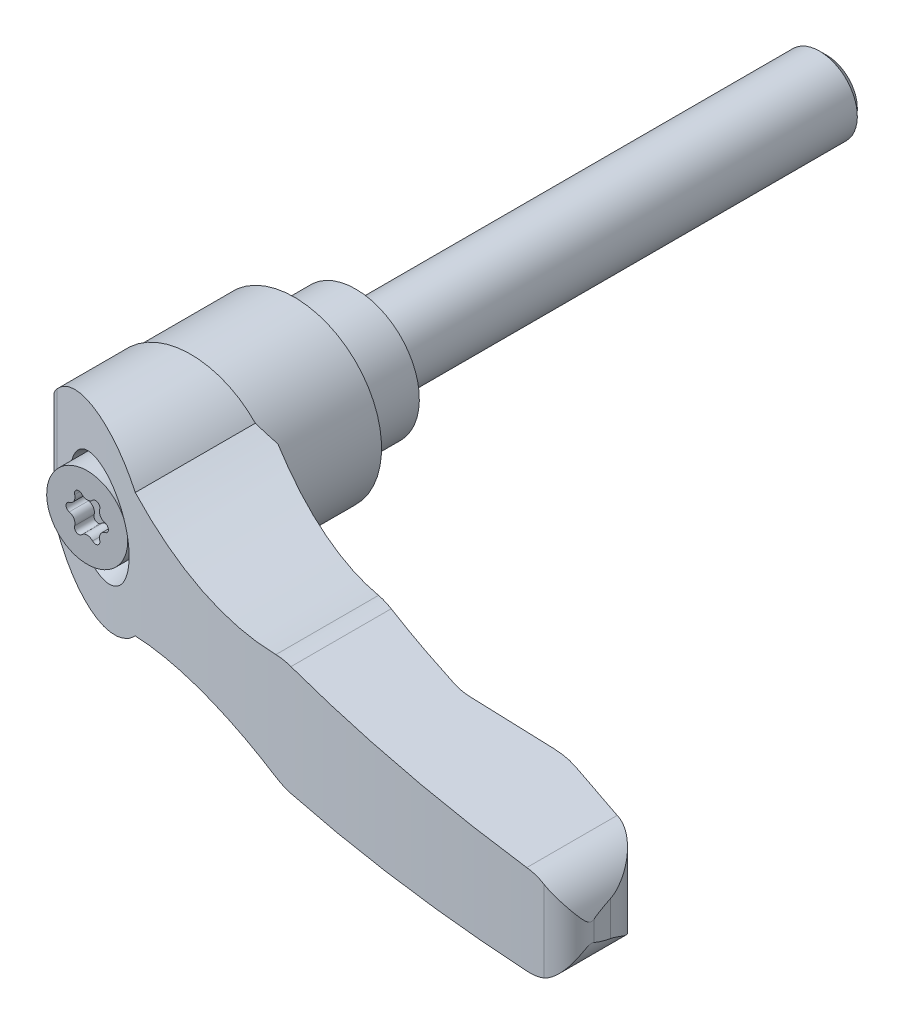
ISO-10303-21;
HEADER;
FILE_DESCRIPTION(('STEP AP214'),'2;1');
FILE_NAME('part.step','',(''),(''),'','','');
FILE_SCHEMA(('AUTOMOTIVE_DESIGN { 1 0 10303 214 1 1 1 1 }'));
ENDSEC;
DATA;
#1=APPLICATION_CONTEXT('core data for automotive mechanical design processes');
#2=APPLICATION_PROTOCOL_DEFINITION('international standard','automotive_design',2000,#1);
#3=PRODUCT_CONTEXT('',#1,'mechanical');
#4=PRODUCT('Part','Part','',(#3));
#5=PRODUCT_RELATED_PRODUCT_CATEGORY('part','',(#4));
#6=PRODUCT_DEFINITION_FORMATION('','',#4);
#7=PRODUCT_DEFINITION_CONTEXT('part definition',#1,'design');
#8=PRODUCT_DEFINITION('design','',#6,#7);
#9=PRODUCT_DEFINITION_SHAPE('','',#8);
#10=(LENGTH_UNIT() NAMED_UNIT(*) SI_UNIT(.MILLI.,.METRE.));
#11=(NAMED_UNIT(*) PLANE_ANGLE_UNIT() SI_UNIT($,.RADIAN.));
#12=(NAMED_UNIT(*) SI_UNIT($,.STERADIAN.) SOLID_ANGLE_UNIT());
#13=UNCERTAINTY_MEASURE_WITH_UNIT(LENGTH_MEASURE(1.E-05),#10,'distance_accuracy_value','');
#14=(GEOMETRIC_REPRESENTATION_CONTEXT(3) GLOBAL_UNCERTAINTY_ASSIGNED_CONTEXT((#13)) GLOBAL_UNIT_ASSIGNED_CONTEXT((#10,
#11,#12)) REPRESENTATION_CONTEXT('',''));
#15=CARTESIAN_POINT('',(0.,0.,0.));
#16=DIRECTION('',(0.,0.,1.));
#17=DIRECTION('',(1.,0.,0.));
#18=AXIS2_PLACEMENT_3D('',#15,#16,#17);
#19=CARTESIAN_POINT('',(0.,0.,-7.116040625));
#20=DIRECTION('',(0.,0.,-1.));
#21=DIRECTION('',(0.,1.,0.));
#22=AXIS2_PLACEMENT_3D('',#19,#20,#21);
#23=CYLINDRICAL_SURFACE('',#22,4.);
#24=CARTESIAN_POINT('',(0.,0.,-49.23));
#25=DIRECTION('',(0.,0.,-1.));
#26=DIRECTION('',(0.,1.,0.));
#27=AXIS2_PLACEMENT_3D('',#24,#25,#26);
#28=CIRCLE('',#27,4.);
#29=CARTESIAN_POINT('',(0.,4.,-49.23));
#30=VERTEX_POINT('',#29);
#31=EDGE_CURVE('E9',#30,#30,#28,.F.);
#32=ORIENTED_EDGE('',*,*,#31,.T.);
#33=EDGE_LOOP('',(#32));
#34=FACE_BOUND('',#33,.T.);
#35=CARTESIAN_POINT('',(0.,0.,0.));
#36=DIRECTION('',(0.,0.,-1.));
#37=DIRECTION('',(0.,1.,0.));
#38=AXIS2_PLACEMENT_3D('',#35,#36,#37);
#39=CIRCLE('',#38,4.);
#40=CARTESIAN_POINT('',(0.,4.,0.));
#41=VERTEX_POINT('',#40);
#42=EDGE_CURVE('E547',#41,#41,#39,.F.);
#43=ORIENTED_EDGE('',*,*,#42,.F.);
#44=EDGE_LOOP('',(#43));
#45=FACE_BOUND('',#44,.T.);
#46=ADVANCED_FACE('F14',(#34,#45),#23,.T.);
#47=CARTESIAN_POINT('',(5.375,0.,0.));
#48=DIRECTION('',(0.,0.,-1.));
#49=DIRECTION('',(0.,1.,0.));
#50=AXIS2_PLACEMENT_3D('',#47,#48,#49);
#51=PLANE('',#50);
#52=ORIENTED_EDGE('',*,*,#42,.T.);
#53=EDGE_LOOP('',(#52));
#54=FACE_BOUND('',#53,.T.);
#55=CARTESIAN_POINT('',(0.,0.,0.));
#56=DIRECTION('',(0.,0.,-1.));
#57=DIRECTION('',(0.,1.,0.));
#58=AXIS2_PLACEMENT_3D('',#55,#56,#57);
#59=CIRCLE('',#58,6.75);
#60=CARTESIAN_POINT('',(0.,6.75,0.));
#61=VERTEX_POINT('',#60);
#62=EDGE_CURVE('E732',#61,#61,#59,.F.);
#63=ORIENTED_EDGE('',*,*,#62,.F.);
#64=EDGE_LOOP('',(#63));
#65=FACE_BOUND('',#64,.T.);
#66=ADVANCED_FACE('F817',(#54,#65),#51,.T.);
#67=CARTESIAN_POINT('',(0.,0.,8.25));
#68=DIRECTION('',(0.,0.,-1.));
#69=DIRECTION('',(0.,1.,0.));
#70=AXIS2_PLACEMENT_3D('',#67,#68,#69);
#71=CYLINDRICAL_SURFACE('',#70,6.75);
#72=ORIENTED_EDGE('',*,*,#62,.T.);
#73=EDGE_LOOP('',(#72));
#74=FACE_BOUND('',#73,.T.);
#75=CARTESIAN_POINT('',(0.,0.,7.15000000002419));
#76=DIRECTION('',(0.,0.,-1.));
#77=DIRECTION('',(1.,0.,0.));
#78=AXIS2_PLACEMENT_3D('',#75,#76,#77);
#79=CIRCLE('',#78,6.74999999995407);
#80=CARTESIAN_POINT('',(6.74999999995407,0.,7.15000000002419));
#81=VERTEX_POINT('',#80);
#82=EDGE_CURVE('E540',#81,#81,#79,.T.);
#83=ORIENTED_EDGE('',*,*,#82,.T.);
#84=EDGE_LOOP('',(#83));
#85=FACE_BOUND('',#84,.T.);
#86=ADVANCED_FACE('F824',(#74,#85),#71,.T.);
#87=CARTESIAN_POINT('',(0.,0.,6.9000000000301));
#88=DIRECTION('',(0.,0.,-1.));
#89=DIRECTION('',(0.,1.,0.));
#90=AXIS2_PLACEMENT_3D('',#87,#88,#89);
#91=CONICAL_SURFACE('',#90,7.000000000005,0.785398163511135);
#92=ORIENTED_EDGE('',*,*,#82,.F.);
#93=EDGE_LOOP('',(#92));
#94=FACE_BOUND('',#93,.T.);
#95=CARTESIAN_POINT('',(0.,0.,6.9));
#96=DIRECTION('',(0.,0.,-1.));
#97=DIRECTION('',(0.,1.,0.));
#98=AXIS2_PLACEMENT_3D('',#95,#96,#97);
#99=CIRCLE('',#98,7.);
#100=CARTESIAN_POINT('',(0.,7.,6.9));
#101=VERTEX_POINT('',#100);
#102=EDGE_CURVE('E536',#101,#101,#99,.T.);
#103=ORIENTED_EDGE('',*,*,#102,.T.);
#104=EDGE_LOOP('',(#103));
#105=FACE_BOUND('',#104,.T.);
#106=ADVANCED_FACE('F832',(#94,#105),#91,.F.);
#107=CARTESIAN_POINT('',(0.,0.,6.2));
#108=DIRECTION('',(0.,0.,-1.));
#109=DIRECTION('',(0.,1.,0.));
#110=AXIS2_PLACEMENT_3D('',#107,#108,#109);
#111=CYLINDRICAL_SURFACE('',#110,7.);
#112=ORIENTED_EDGE('',*,*,#102,.F.);
#113=EDGE_LOOP('',(#112));
#114=FACE_BOUND('',#113,.T.);
#115=CARTESIAN_POINT('',(0.,0.,6.5));
#116=DIRECTION('',(0.,0.,-1.));
#117=DIRECTION('',(0.,1.,0.));
#118=AXIS2_PLACEMENT_3D('',#115,#116,#117);
#119=CIRCLE('',#118,7.);
#120=CARTESIAN_POINT('',(0.,7.,6.5));
#121=VERTEX_POINT('',#120);
#122=EDGE_CURVE('E539',#121,#121,#119,.F.);
#123=ORIENTED_EDGE('',*,*,#122,.F.);
#124=EDGE_LOOP('',(#123));
#125=FACE_BOUND('',#124,.T.);
#126=ADVANCED_FACE('F839',(#114,#125),#111,.F.);
#127=CARTESIAN_POINT('',(-9.01003775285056,-19.,6.5));
#128=DIRECTION('',(0.707106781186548,0.,0.707106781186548));
#129=DIRECTION('',(-0.707106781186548,0.,0.707106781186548));
#130=AXIS2_PLACEMENT_3D('',#127,#128,#129);
#131=PLANE('',#130);
#132=DIRECTION('',(0.,1.,0.));
#133=VECTOR('',#132,1.);
#134=CARTESIAN_POINT('',(-9.01003775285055,0.,6.5));
#135=LINE('',#134,#133);
#136=CARTESIAN_POINT('',(-9.01003775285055,-2.13584185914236,6.5));
#137=VERTEX_POINT('',#136);
#138=CARTESIAN_POINT('',(-9.01003775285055,2.13584185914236,6.5));
#139=VERTEX_POINT('',#138);
#140=EDGE_CURVE('E727',#137,#139,#135,.T.);
#141=ORIENTED_EDGE('',*,*,#140,.F.);
#142=CARTESIAN_POINT('',(-0.00999999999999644,0.,-2.50003775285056));
#143=DIRECTION('',(0.707106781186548,0.,0.707106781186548));
#144=DIRECTION('',(-0.707106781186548,0.,0.707106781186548));
#145=AXIS2_PLACEMENT_3D('',#142,#143,#144);
#146=ELLIPSE('',#145,13.0814754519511,9.25);
#147=EDGE_CURVE('E724',#139,#137,#146,.T.);
#148=ORIENTED_EDGE('',*,*,#147,.F.);
#149=EDGE_LOOP('',(#141,#148));
#150=FACE_BOUND('',#149,.T.);
#151=ADVANCED_FACE('F843',(#150),#131,.F.);
#152=CARTESIAN_POINT('',(-4.635,0.,6.5));
#153=DIRECTION('',(0.,0.,-1.));
#154=DIRECTION('',(0.,1.,0.));
#155=AXIS2_PLACEMENT_3D('',#152,#153,#154);
#156=PLANE('',#155);
#157=ORIENTED_EDGE('',*,*,#140,.T.);
#158=CARTESIAN_POINT('',(-0.00999999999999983,0.,6.5));
#159=DIRECTION('',(0.,0.,1.));
#160=DIRECTION('',(-1.,0.,0.));
#161=AXIS2_PLACEMENT_3D('',#158,#159,#160);
#162=CIRCLE('',#161,9.25);
#163=EDGE_CURVE('E720',#137,#139,#162,.T.);
#164=ORIENTED_EDGE('',*,*,#163,.F.);
#165=EDGE_LOOP('',(#157,#164));
#166=FACE_BOUND('',#165,.T.);
#167=ORIENTED_EDGE('',*,*,#122,.T.);
#168=EDGE_LOOP('',(#167));
#169=FACE_BOUND('',#168,.T.);
#170=ADVANCED_FACE('F847',(#166,#169),#156,.T.);
#171=CARTESIAN_POINT('',(-0.0100000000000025,0.,13.5625));
#172=DIRECTION('',(0.,0.,1.));
#173=DIRECTION('',(-1.,0.,0.));
#174=AXIS2_PLACEMENT_3D('',#171,#172,#173);
#175=CYLINDRICAL_SURFACE('',#174,9.25);
#176=ORIENTED_EDGE('',*,*,#163,.T.);
#177=ORIENTED_EDGE('',*,*,#147,.T.);
#178=EDGE_LOOP('',(#176,#177));
#179=FACE_BOUND('',#178,.T.);
#180=CARTESIAN_POINT('',(-0.010000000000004,0.,17.5));
#181=DIRECTION('',(0.,0.,1.));
#182=DIRECTION('',(-1.,0.,0.));
#183=AXIS2_PLACEMENT_3D('',#180,#181,#182);
#184=CIRCLE('',#183,9.25);
#185=CARTESIAN_POINT('',(-9.26,0.,17.5));
#186=VERTEX_POINT('',#185);
#187=CARTESIAN_POINT('',(9.23999999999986,0.,17.5000000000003));
#188=VERTEX_POINT('',#187);
#189=EDGE_CURVE('E710',#186,#188,#184,.T.);
#190=ORIENTED_EDGE('',*,*,#189,.F.);
#191=CARTESIAN_POINT('',(-0.010000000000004,0.,17.5));
#192=DIRECTION('',(0.,0.,1.));
#193=DIRECTION('',(-1.,0.,0.));
#194=AXIS2_PLACEMENT_3D('',#191,#192,#193);
#195=CIRCLE('',#194,9.25);
#196=EDGE_CURVE('E531',#188,#186,#195,.T.);
#197=ORIENTED_EDGE('',*,*,#196,.F.);
#198=EDGE_LOOP('',(#190,#197));
#199=FACE_BOUND('',#198,.T.);
#200=ADVANCED_FACE('F717',(#179,#199),#175,.T.);
#201=CARTESIAN_POINT('',(64.6274051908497,-10.5,37.5817950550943));
#202=DIRECTION('',(0.992331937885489,0.,-0.123601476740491));
#203=DIRECTION('',(0.123601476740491,0.,0.992331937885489));
#204=AXIS2_PLACEMENT_3D('',#201,#202,#203);
#205=PLANE('',#204);
#206=CARTESIAN_POINT('',(60.25,0.,2.43788666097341));
#207=DIRECTION('',(0.992331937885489,0.,-0.123601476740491));
#208=DIRECTION('',(0.123601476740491,0.,0.992331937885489));
#209=AXIS2_PLACEMENT_3D('',#206,#207,#208);
#210=ELLIPSE('',#209,38.4299615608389,4.75);
#211=CARTESIAN_POINT('',(64.8745408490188,1.08449155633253,39.5659186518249));
#212=VERTEX_POINT('',#211);
#213=CARTESIAN_POINT('',(64.6274051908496,1.84413226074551,37.5817950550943));
#214=VERTEX_POINT('',#213);
#215=EDGE_CURVE('E421',#212,#214,#210,.F.);
#216=ORIENTED_EDGE('',*,*,#215,.F.);
#217=DIRECTION('',(0.,-1.,0.));
#218=VECTOR('',#217,1.);
#219=CARTESIAN_POINT('',(64.8745408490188,-10.5,39.5659186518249));
#220=LINE('',#219,#218);
#221=CARTESIAN_POINT('',(64.8745408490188,-1.08449155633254,39.5659186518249));
#222=VERTEX_POINT('',#221);
#223=EDGE_CURVE('E460',#222,#212,#220,.F.);
#224=ORIENTED_EDGE('',*,*,#223,.F.);
#225=CARTESIAN_POINT('',(60.25,0.,2.43788666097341));
#226=DIRECTION('',(0.992331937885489,0.,-0.123601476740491));
#227=DIRECTION('',(0.123601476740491,0.,0.992331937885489));
#228=AXIS2_PLACEMENT_3D('',#225,#226,#227);
#229=ELLIPSE('',#228,38.4299615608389,4.75);
#230=CARTESIAN_POINT('',(64.6274051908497,-1.84413226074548,37.5817950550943));
#231=VERTEX_POINT('',#230);
#232=EDGE_CURVE('E444',#231,#222,#229,.F.);
#233=ORIENTED_EDGE('',*,*,#232,.F.);
#234=DIRECTION('',(0.,-1.,0.));
#235=VECTOR('',#234,1.);
#236=CARTESIAN_POINT('',(64.6274051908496,-10.5,37.5817950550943));
#237=LINE('',#236,#235);
#238=EDGE_CURVE('E718',#214,#231,#237,.T.);
#239=ORIENTED_EDGE('',*,*,#238,.F.);
#240=EDGE_LOOP('',(#216,#224,#233,#239));
#241=FACE_BOUND('',#240,.T.);
#242=ADVANCED_FACE('F430',(#241),#205,.T.);
#243=CARTESIAN_POINT('',(58.6337202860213,-10.5,38.3283479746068));
#244=DIRECTION('',(0.,-1.,0.));
#245=DIRECTION('',(1.,0.,0.));
#246=AXIS2_PLACEMENT_3D('',#243,#244,#245);
#247=CYLINDRICAL_SURFACE('',#246,6.04);
#248=CARTESIAN_POINT('',(64.6274051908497,1.84413226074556,37.5817950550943));
#249=CARTESIAN_POINT('',(64.6175868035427,1.86745330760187,37.5030045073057));
#250=CARTESIAN_POINT('',(64.6063375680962,1.89362327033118,37.4253204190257));
#251=CARTESIAN_POINT('',(64.5811702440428,1.95049016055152,37.2721928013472));
#252=CARTESIAN_POINT('',(64.5672561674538,1.98118026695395,37.1967460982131));
#253=CARTESIAN_POINT('',(64.5369883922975,2.04585034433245,37.0482136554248));
#254=CARTESIAN_POINT('',(64.520645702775,2.07981523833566,36.9751189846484));
#255=CARTESIAN_POINT('',(64.4855821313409,2.15032519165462,36.8307396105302));
#256=CARTESIAN_POINT('',(64.4668602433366,2.18687133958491,36.7594556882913));
#257=CARTESIAN_POINT('',(64.4072221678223,2.29938724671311,36.547961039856));
#258=CARTESIAN_POINT('',(64.3628565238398,2.37818379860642,36.410218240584));
#259=CARTESIAN_POINT('',(64.2652007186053,2.53960895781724,36.1400450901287));
#260=CARTESIAN_POINT('',(64.2118976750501,2.6222429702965,36.007622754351));
#261=CARTESIAN_POINT('',(64.077119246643,2.81672317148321,35.7040219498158));
#262=CARTESIAN_POINT('',(63.9921849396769,2.92909268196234,35.5347005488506));
#263=CARTESIAN_POINT('',(63.8063278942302,3.15216626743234,35.2039790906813));
#264=CARTESIAN_POINT('',(63.7054078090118,3.26287061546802,35.0425777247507));
#265=CARTESIAN_POINT('',(63.4870671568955,3.47959027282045,34.7278934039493));
#266=CARTESIAN_POINT('',(63.369645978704,3.58560540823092,34.5746107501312));
#267=CARTESIAN_POINT('',(63.1179209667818,3.78996521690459,34.277236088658));
#268=CARTESIAN_POINT('',(62.9836257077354,3.88831374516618,34.1331394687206));
#269=CARTESIAN_POINT('',(62.6561598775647,4.10136712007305,33.815313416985));
#270=CARTESIAN_POINT('',(62.4571888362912,4.21258905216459,33.6450495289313));
#271=CARTESIAN_POINT('',(62.1378586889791,4.36029911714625,33.4069452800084));
#272=CARTESIAN_POINT('',(62.0281124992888,4.40629516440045,33.3305585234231));
#273=CARTESIAN_POINT('',(61.8018114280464,4.49098569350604,33.1841350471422));
#274=CARTESIAN_POINT('',(61.6852609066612,4.52968478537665,33.1140943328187));
#275=CARTESIAN_POINT('',(61.4786111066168,4.58924867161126,32.9993621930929));
#276=CARTESIAN_POINT('',(61.3900115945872,4.61209493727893,32.9529824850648));
#277=CARTESIAN_POINT('',(61.2097340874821,4.65295056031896,32.8642982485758));
#278=CARTESIAN_POINT('',(61.1180570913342,4.67096147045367,32.82199241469));
#279=CARTESIAN_POINT('',(60.9313596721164,4.70183469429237,32.7415027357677));
#280=CARTESIAN_POINT('',(60.8363219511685,4.71466416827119,32.7033462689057));
#281=CARTESIAN_POINT('',(60.6438287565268,4.73463763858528,32.631712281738));
#282=CARTESIAN_POINT('',(60.5463713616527,4.74177695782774,32.5982386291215));
#283=CARTESIAN_POINT('',(60.4479724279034,4.74587261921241,32.5672639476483));
#284=B_SPLINE_CURVE_WITH_KNOTS('',3,(#248,#249,#250,#251,#252,#253,#254,#255,#256,#257,#258,
#259,#260,#261,#262,#263,#264,#265,#266,#267,#268,#269,#270,#271,#272,#273,#274,#275,#276,#277,
#278,#279,#280,#281,#282,#283),.UNSPECIFIED.,.F.,.F.,(4,2,2,2,2,2,2,2,2,2,2,2,2,2,2,2,2,4),(0.,
0.248076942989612,0.495783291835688,0.742399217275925,0.989119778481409,1.48293160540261,
1.97746142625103,2.63745339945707,3.29733594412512,3.95724294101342,4.61681594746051,
5.46693586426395,5.89075482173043,6.31430511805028,6.62183365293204,6.92926331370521,
7.23861197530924,7.54821464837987),.UNSPECIFIED.);
#285=CARTESIAN_POINT('',(60.4479724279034,4.74587261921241,32.5672639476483));
#286=VERTEX_POINT('',#285);
#287=EDGE_CURVE('E412',#214,#286,#284,.T.);
#288=ORIENTED_EDGE('',*,*,#287,.F.);
#289=ORIENTED_EDGE('',*,*,#238,.T.);
#290=CARTESIAN_POINT('',(60.4479724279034,-4.74587261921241,32.5672639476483));
#291=CARTESIAN_POINT('',(60.5755504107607,-4.74057354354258,32.6074069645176));
#292=CARTESIAN_POINT('',(60.7015088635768,-4.73014540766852,32.6517620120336));
#293=CARTESIAN_POINT('',(60.9490652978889,-4.69992242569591,32.7481786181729));
#294=CARTESIAN_POINT('',(61.0706698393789,-4.6801423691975,32.8002279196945));
#295=CARTESIAN_POINT('',(61.3074659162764,-4.63235500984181,32.9108206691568));
#296=CARTESIAN_POINT('',(61.4227141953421,-4.60444273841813,32.9692844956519));
#297=CARTESIAN_POINT('',(61.6477173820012,-4.54120548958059,33.0925213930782));
#298=CARTESIAN_POINT('',(61.7574696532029,-4.50587699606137,33.1572974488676));
#299=CARTESIAN_POINT('',(61.9940137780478,-4.42040174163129,33.307032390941));
#300=CARTESIAN_POINT('',(62.1193938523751,-4.36870213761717,33.3933358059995));
#301=CARTESIAN_POINT('',(62.3610721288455,-4.25718277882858,33.5732278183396));
#302=CARTESIAN_POINT('',(62.4773638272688,-4.19735729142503,33.6668215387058));
#303=CARTESIAN_POINT('',(62.7012840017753,-4.07066877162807,33.8608437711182));
#304=CARTESIAN_POINT('',(62.8088611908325,-4.0037687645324,33.9613071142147));
#305=CARTESIAN_POINT('',(63.0146476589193,-3.86453813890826,34.1677809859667));
#306=CARTESIAN_POINT('',(63.1128596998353,-3.79220913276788,34.2737898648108));
#307=CARTESIAN_POINT('',(63.3331746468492,-3.61700510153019,34.5290929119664));
#308=CARTESIAN_POINT('',(63.4514763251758,-3.51235864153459,34.6804594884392));
#309=CARTESIAN_POINT('',(63.6718053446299,-3.29808480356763,34.9913387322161));
#310=CARTESIAN_POINT('',(63.7738256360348,-3.18845529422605,35.1508548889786));
#311=CARTESIAN_POINT('',(63.961662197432,-2.9676568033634,35.4770445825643));
#312=CARTESIAN_POINT('',(64.0475378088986,-2.85649513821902,35.6436890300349));
#313=CARTESIAN_POINT('',(64.2038484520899,-2.63586419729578,35.9851508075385));
#314=CARTESIAN_POINT('',(64.2742871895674,-2.52639452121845,36.1599661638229));
#315=CARTESIAN_POINT('',(64.3705847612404,-2.36382517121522,36.4361542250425));
#316=CARTESIAN_POINT('',(64.4019853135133,-2.30809068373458,36.5340606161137));
#317=CARTESIAN_POINT('',(64.4601539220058,-2.20019362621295,36.7330390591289));
#318=CARTESIAN_POINT('',(64.4869269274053,-2.14802727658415,36.8341075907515));
#319=CARTESIAN_POINT('',(64.5357331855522,-2.04890785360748,37.0402846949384));
#320=CARTESIAN_POINT('',(64.5577546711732,-2.00196785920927,37.1454025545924));
#321=CARTESIAN_POINT('',(64.596614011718,-1.91618262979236,37.360168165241));
#322=CARTESIAN_POINT('',(64.6134353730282,-1.87736327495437,37.4698291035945));
#323=CARTESIAN_POINT('',(64.6274051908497,-1.84413226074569,37.5817950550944));
#324=B_SPLINE_CURVE_WITH_KNOTS('',3,(#290,#291,#292,#293,#294,#295,#296,#297,#298,#299,#300,
#301,#302,#303,#304,#305,#306,#307,#308,#309,#310,#311,#312,#313,#314,#315,#316,#317,#318,#319,
#320,#321,#322,#323),.UNSPECIFIED.,.F.,.F.,(4,2,2,2,2,2,2,2,2,2,2,2,2,2,2,2,4),(0.,
0.401264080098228,0.801895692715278,1.19802151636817,1.59433557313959,2.0758833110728,
2.55777255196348,3.04231807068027,3.52672024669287,4.18208013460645,4.83772302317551,
5.49090678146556,6.1439335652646,6.49464389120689,6.84497677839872,7.19616755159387,
7.54846105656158),.UNSPECIFIED.);
#325=CARTESIAN_POINT('',(60.4479724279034,-4.74587261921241,32.5672639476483));
#326=VERTEX_POINT('',#325);
#327=EDGE_CURVE('E436',#326,#231,#324,.T.);
#328=ORIENTED_EDGE('',*,*,#327,.F.);
#329=DIRECTION('',(0.,-1.,0.));
#330=VECTOR('',#329,1.);
#331=CARTESIAN_POINT('',(60.4479724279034,-10.5,32.5672639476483));
#332=LINE('',#331,#330);
#333=EDGE_CURVE('E526',#286,#326,#332,.T.);
#334=ORIENTED_EDGE('',*,*,#333,.F.);
#335=EDGE_LOOP('',(#288,#289,#328,#334));
#336=FACE_BOUND('',#335,.T.);
#337=ADVANCED_FACE('F424',(#336),#247,.T.);
#338=CARTESIAN_POINT('',(-9.26,-10.5,17.5));
#339=DIRECTION('',(0.,0.,-1.));
#340=DIRECTION('',(0.,1.,0.));
#341=AXIS2_PLACEMENT_3D('',#338,#339,#340);
#342=PLANE('',#341);
#343=DIRECTION('',(0.,-1.,0.));
#344=VECTOR('',#343,1.);
#345=CARTESIAN_POINT('',(-9.26,-10.5,17.5));
#346=LINE('',#345,#344);
#347=CARTESIAN_POINT('',(-9.26,2.12188595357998,17.5));
#348=VERTEX_POINT('',#347);
#349=EDGE_CURVE('E527',#348,#186,#346,.T.);
#350=ORIENTED_EDGE('',*,*,#349,.F.);
#351=CARTESIAN_POINT('',(0.,0.,17.5));
#352=DIRECTION('',(0.,0.,1.));
#353=DIRECTION('',(0.,-1.,0.));
#354=AXIS2_PLACEMENT_3D('',#351,#352,#353);
#355=CIRCLE('',#354,9.5);
#356=CARTESIAN_POINT('',(6.84374087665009,6.58887022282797,17.5));
#357=VERTEX_POINT('',#356);
#358=EDGE_CURVE('E338',#357,#348,#355,.T.);
#359=ORIENTED_EDGE('',*,*,#358,.F.);
#360=CARTESIAN_POINT('',(19.25,44.09,17.5));
#361=DIRECTION('',(0.,0.,1.));
#362=DIRECTION('',(0.,-1.,0.));
#363=AXIS2_PLACEMENT_3D('',#360,#361,#362);
#364=CIRCLE('',#363,39.5);
#365=CARTESIAN_POINT('',(9.23999999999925,5.87940068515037,17.5000000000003));
#366=VERTEX_POINT('',#365);
#367=EDGE_CURVE('E339',#357,#366,#364,.T.);
#368=ORIENTED_EDGE('',*,*,#367,.T.);
#369=DIRECTION('',(0.,-1.,0.));
#370=VECTOR('',#369,1.);
#371=CARTESIAN_POINT('',(9.23999999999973,-10.5,17.5000000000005));
#372=LINE('',#371,#370);
#373=EDGE_CURVE('E471',#366,#188,#372,.T.);
#374=ORIENTED_EDGE('',*,*,#373,.T.);
#375=ORIENTED_EDGE('',*,*,#196,.T.);
#376=EDGE_LOOP('',(#350,#359,#368,#374,#375));
#377=FACE_BOUND('',#376,.T.);
#378=ADVANCED_FACE('F429',(#377),#342,.T.);
#379=CARTESIAN_POINT('',(-9.26,-10.5,21.2038249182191));
#380=DIRECTION('',(-1.,0.,0.));
#381=DIRECTION('',(0.,-1.,0.));
#382=AXIS2_PLACEMENT_3D('',#379,#380,#381);
#383=PLANE('',#382);
#384=ORIENTED_EDGE('',*,*,#349,.T.);
#385=DIRECTION('',(0.,1.,0.));
#386=VECTOR('',#385,1.);
#387=CARTESIAN_POINT('',(-9.26,-10.5,17.5));
#388=LINE('',#387,#386);
#389=CARTESIAN_POINT('',(-9.26,-2.12188595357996,17.5));
#390=VERTEX_POINT('',#389);
#391=EDGE_CURVE('E706',#390,#186,#388,.T.);
#392=ORIENTED_EDGE('',*,*,#391,.F.);
#393=DIRECTION('',(0.,0.,1.));
#394=VECTOR('',#393,1.);
#395=CARTESIAN_POINT('',(-9.26,-2.12188595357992,42.5));
#396=LINE('',#395,#394);
#397=CARTESIAN_POINT('',(-9.26,-2.12188595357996,21.2038249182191));
#398=VERTEX_POINT('',#397);
#399=EDGE_CURVE('E530',#398,#390,#396,.F.);
#400=ORIENTED_EDGE('',*,*,#399,.F.);
#401=DIRECTION('',(0.,-1.,0.));
#402=VECTOR('',#401,1.);
#403=CARTESIAN_POINT('',(-9.26,-10.5,21.2038249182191));
#404=LINE('',#403,#402);
#405=CARTESIAN_POINT('',(-9.26,2.12188595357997,21.2038249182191));
#406=VERTEX_POINT('',#405);
#407=EDGE_CURVE('E493',#406,#398,#404,.T.);
#408=ORIENTED_EDGE('',*,*,#407,.F.);
#409=DIRECTION('',(0.,0.,1.));
#410=VECTOR('',#409,1.);
#411=CARTESIAN_POINT('',(-9.26,2.12188595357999,42.5));
#412=LINE('',#411,#410);
#413=EDGE_CURVE('E491',#348,#406,#412,.T.);
#414=ORIENTED_EDGE('',*,*,#413,.F.);
#415=EDGE_LOOP('',(#384,#392,#400,#408,#414));
#416=FACE_BOUND('',#415,.T.);
#417=ADVANCED_FACE('F708',(#416),#383,.T.);
#418=CARTESIAN_POINT('',(-9.26,-10.5,17.5));
#419=DIRECTION('',(0.,0.,-1.));
#420=DIRECTION('',(0.,1.,0.));
#421=AXIS2_PLACEMENT_3D('',#418,#419,#420);
#422=PLANE('',#421);
#423=DIRECTION('',(0.,-1.,0.));
#424=VECTOR('',#423,1.);
#425=CARTESIAN_POINT('',(9.23999999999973,-10.5,17.5000000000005));
#426=LINE('',#425,#424);
#427=CARTESIAN_POINT('',(9.23999999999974,-5.87940068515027,17.5000000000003));
#428=VERTEX_POINT('',#427);
#429=EDGE_CURVE('E639',#188,#428,#426,.T.);
#430=ORIENTED_EDGE('',*,*,#429,.T.);
#431=CARTESIAN_POINT('',(19.25,-44.09,17.5));
#432=DIRECTION('',(0.,0.,1.));
#433=DIRECTION('',(0.,-1.,0.));
#434=AXIS2_PLACEMENT_3D('',#431,#432,#433);
#435=CIRCLE('',#434,39.5);
#436=CARTESIAN_POINT('',(6.84374087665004,-6.588870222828,17.5));
#437=VERTEX_POINT('',#436);
#438=EDGE_CURVE('E305',#428,#437,#435,.T.);
#439=ORIENTED_EDGE('',*,*,#438,.T.);
#440=CARTESIAN_POINT('',(0.,0.,17.5));
#441=DIRECTION('',(0.,0.,1.));
#442=DIRECTION('',(0.,-1.,0.));
#443=AXIS2_PLACEMENT_3D('',#440,#441,#442);
#444=CIRCLE('',#443,9.5);
#445=EDGE_CURVE('E496',#390,#437,#444,.T.);
#446=ORIENTED_EDGE('',*,*,#445,.F.);
#447=ORIENTED_EDGE('',*,*,#391,.T.);
#448=ORIENTED_EDGE('',*,*,#189,.T.);
#449=EDGE_LOOP('',(#430,#439,#446,#447,#448));
#450=FACE_BOUND('',#449,.T.);
#451=ADVANCED_FACE('F701',(#450),#422,.T.);
#452=CARTESIAN_POINT('',(53.8294507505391,-10.5,30.4829917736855));
#453=DIRECTION('',(0.300372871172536,0.,-0.95382185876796));
#454=DIRECTION('',(0.95382185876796,0.,0.300372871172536));
#455=AXIS2_PLACEMENT_3D('',#452,#453,#454);
#456=PLANE('',#455);
#457=CARTESIAN_POINT('',(60.25,0.,32.5049194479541));
#458=DIRECTION('',(0.300372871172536,0.,-0.95382185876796));
#459=DIRECTION('',(0.95382185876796,0.,0.300372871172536));
#460=AXIS2_PLACEMENT_3D('',#457,#458,#459);
#461=ELLIPSE('',#460,4.97996555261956,4.75);
#462=CARTESIAN_POINT('',(60.25,4.75,32.5049194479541));
#463=VERTEX_POINT('',#462);
#464=EDGE_CURVE('E461',#286,#463,#461,.F.);
#465=ORIENTED_EDGE('',*,*,#464,.F.);
#466=ORIENTED_EDGE('',*,*,#333,.T.);
#467=CARTESIAN_POINT('',(60.25,0.,32.5049194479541));
#468=DIRECTION('',(0.300372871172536,0.,-0.95382185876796));
#469=DIRECTION('',(0.95382185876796,0.,0.300372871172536));
#470=AXIS2_PLACEMENT_3D('',#467,#468,#469);
#471=ELLIPSE('',#470,4.97996555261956,4.75);
#472=CARTESIAN_POINT('',(60.25,-4.75,32.5049194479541));
#473=VERTEX_POINT('',#472);
#474=EDGE_CURVE('E445',#473,#326,#471,.F.);
#475=ORIENTED_EDGE('',*,*,#474,.F.);
#476=DIRECTION('',(-0.953255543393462,-0.0344545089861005,-0.300194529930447));
#477=VECTOR('',#476,1.);
#478=CARTESIAN_POINT('',(60.25,-4.75,32.5049194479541));
#479=LINE('',#478,#477);
#480=CARTESIAN_POINT('',(53.8294507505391,-4.98206460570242,30.4829917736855));
#481=VERTEX_POINT('',#480);
#482=EDGE_CURVE('E508',#473,#481,#479,.T.);
#483=ORIENTED_EDGE('',*,*,#482,.T.);
#484=DIRECTION('',(0.,-1.,0.));
#485=VECTOR('',#484,1.);
#486=CARTESIAN_POINT('',(53.8294507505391,-10.5,30.4829917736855));
#487=LINE('',#486,#485);
#488=CARTESIAN_POINT('',(53.8294507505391,4.98206460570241,30.4829917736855));
#489=VERTEX_POINT('',#488);
#490=EDGE_CURVE('E523',#489,#481,#487,.T.);
#491=ORIENTED_EDGE('',*,*,#490,.F.);
#492=DIRECTION('',(0.953255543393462,-0.0344545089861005,0.300194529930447));
#493=VECTOR('',#492,1.);
#494=CARTESIAN_POINT('',(53.8294507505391,4.98206460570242,30.4829917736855));
#495=LINE('',#494,#493);
#496=EDGE_CURVE('E473',#489,#463,#495,.T.);
#497=ORIENTED_EDGE('',*,*,#496,.T.);
#498=EDGE_LOOP('',(#465,#466,#475,#483,#491,#497));
#499=FACE_BOUND('',#498,.T.);
#500=ADVANCED_FACE('F868',(#499),#456,.T.);
#501=CARTESIAN_POINT('',(51.0780352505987,-10.5,39.22));
#502=DIRECTION('',(0.,-1.,0.));
#503=DIRECTION('',(1.,0.,0.));
#504=AXIS2_PLACEMENT_3D('',#501,#502,#503);
#505=CYLINDRICAL_SURFACE('',#504,9.15999999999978);
#506=CARTESIAN_POINT('',(51.0780352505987,5.08151188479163,39.22));
#507=DIRECTION('',(-0.0361204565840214,-0.999347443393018,0.));
#508=DIRECTION('',(0.999347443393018,-0.0361204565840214,0.));
#509=AXIS2_PLACEMENT_3D('',#506,#507,#508);
#510=ELLIPSE('',#509,9.16598132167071,9.15999999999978);
#511=CARTESIAN_POINT('',(51.0780352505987,5.08151188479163,30.06));
#512=VERTEX_POINT('',#511);
#513=EDGE_CURVE('E476',#512,#489,#510,.T.);
#514=ORIENTED_EDGE('',*,*,#513,.T.);
#515=ORIENTED_EDGE('',*,*,#490,.T.);
#516=CARTESIAN_POINT('',(51.0780352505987,-5.08151188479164,39.22));
#517=DIRECTION('',(-0.0361204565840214,0.999347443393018,0.));
#518=DIRECTION('',(-0.999347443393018,-0.0361204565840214,0.));
#519=AXIS2_PLACEMENT_3D('',#516,#517,#518);
#520=ELLIPSE('',#519,9.16598132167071,9.15999999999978);
#521=CARTESIAN_POINT('',(51.0780352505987,-5.08151188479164,30.06));
#522=VERTEX_POINT('',#521);
#523=EDGE_CURVE('E303',#481,#522,#520,.T.);
#524=ORIENTED_EDGE('',*,*,#523,.T.);
#525=DIRECTION('',(0.,1.,0.));
#526=VECTOR('',#525,1.);
#527=CARTESIAN_POINT('',(51.0780352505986,-10.5,30.06));
#528=LINE('',#527,#526);
#529=EDGE_CURVE('E520',#512,#522,#528,.F.);
#530=ORIENTED_EDGE('',*,*,#529,.F.);
#531=EDGE_LOOP('',(#514,#515,#524,#530));
#532=FACE_BOUND('',#531,.T.);
#533=ADVANCED_FACE('F877',(#532),#505,.T.);
#534=CARTESIAN_POINT('',(42.239481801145,-10.5,30.06));
#535=DIRECTION('',(0.,0.,-1.));
#536=DIRECTION('',(0.,1.,0.));
#537=AXIS2_PLACEMENT_3D('',#534,#535,#536);
#538=PLANE('',#537);
#539=DIRECTION('',(0.999347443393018,-0.0361204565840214,0.));
#540=VECTOR('',#539,1.);
#541=CARTESIAN_POINT('',(30.3472861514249,5.83080496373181,30.06));
#542=LINE('',#541,#540);
#543=CARTESIAN_POINT('',(42.239481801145,5.4009729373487,30.06));
#544=VERTEX_POINT('',#543);
#545=EDGE_CURVE('E477',#544,#512,#542,.T.);
#546=ORIENTED_EDGE('',*,*,#545,.T.);
#547=ORIENTED_EDGE('',*,*,#529,.T.);
#548=DIRECTION('',(-0.999347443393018,-0.0361204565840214,0.));
#549=VECTOR('',#548,1.);
#550=CARTESIAN_POINT('',(60.25,-4.75,30.06));
#551=LINE('',#550,#549);
#552=CARTESIAN_POINT('',(42.239481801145,-5.4009729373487,30.06));
#553=VERTEX_POINT('',#552);
#554=EDGE_CURVE('E505',#522,#553,#551,.T.);
#555=ORIENTED_EDGE('',*,*,#554,.T.);
#556=DIRECTION('',(0.,-1.,0.));
#557=VECTOR('',#556,1.);
#558=CARTESIAN_POINT('',(42.239481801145,-10.5,30.06));
#559=LINE('',#558,#557);
#560=EDGE_CURVE('E518',#553,#544,#559,.F.);
#561=ORIENTED_EDGE('',*,*,#560,.T.);
#562=EDGE_LOOP('',(#546,#547,#555,#561));
#563=FACE_BOUND('',#562,.T.);
#564=ADVANCED_FACE('F880',(#563),#538,.T.);
#565=CARTESIAN_POINT('',(42.2394818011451,-10.5,23.0799999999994));
#566=DIRECTION('',(0.,-1.,0.));
#567=DIRECTION('',(1.,0.,0.));
#568=AXIS2_PLACEMENT_3D('',#565,#566,#567);
#569=CYLINDRICAL_SURFACE('',#568,6.98000000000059);
#570=DIRECTION('',(0.,-1.,0.));
#571=VECTOR('',#570,1.);
#572=CARTESIAN_POINT('',(40.3024609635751,-10.5,29.785844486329));
#573=LINE('',#572,#571);
#574=CARTESIAN_POINT('',(40.3024609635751,-5.47098470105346,29.7858444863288));
#575=VERTEX_POINT('',#574);
#576=CARTESIAN_POINT('',(40.3024609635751,5.47098470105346,29.7858444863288));
#577=VERTEX_POINT('',#576);
#578=EDGE_CURVE('E535',#575,#577,#573,.F.);
#579=ORIENTED_EDGE('',*,*,#578,.T.);
#580=CARTESIAN_POINT('',(42.2394818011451,5.40097293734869,23.0799999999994));
#581=DIRECTION('',(-0.0361204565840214,-0.999347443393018,0.));
#582=DIRECTION('',(0.999347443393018,-0.0361204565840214,0.));
#583=AXIS2_PLACEMENT_3D('',#580,#581,#582);
#584=ELLIPSE('',#583,6.98455781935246,6.98000000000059);
#585=EDGE_CURVE('E480',#577,#544,#584,.F.);
#586=ORIENTED_EDGE('',*,*,#585,.T.);
#587=ORIENTED_EDGE('',*,*,#560,.F.);
#588=CARTESIAN_POINT('',(42.2394818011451,-5.4009729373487,23.0799999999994));
#589=DIRECTION('',(-0.0361204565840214,0.999347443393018,0.));
#590=DIRECTION('',(-0.999347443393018,-0.0361204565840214,0.));
#591=AXIS2_PLACEMENT_3D('',#588,#589,#590);
#592=ELLIPSE('',#591,6.98455781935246,6.98000000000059);
#593=EDGE_CURVE('E507',#553,#575,#592,.F.);
#594=ORIENTED_EDGE('',*,*,#593,.T.);
#595=EDGE_LOOP('',(#579,#586,#587,#594));
#596=FACE_BOUND('',#595,.T.);
#597=ADVANCED_FACE('F313',(#596),#569,.F.);
#598=CARTESIAN_POINT('',(88.9416647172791,-10.5,-138.600024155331));
#599=DIRECTION('',(0.,-1.,0.));
#600=DIRECTION('',(1.,0.,0.));
#601=AXIS2_PLACEMENT_3D('',#598,#599,#600);
#602=CYLINDRICAL_SURFACE('',#601,175.27);
#603=CARTESIAN_POINT('',(30.3472861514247,5.83080496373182,26.5855433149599));
#604=CARTESIAN_POINT('',(30.1696679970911,5.83722947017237,26.5225405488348));
#605=CARTESIAN_POINT('',(29.9919650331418,5.83772087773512,26.45918181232));
#606=CARTESIAN_POINT('',(29.6377732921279,5.82691956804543,26.3322542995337));
#607=CARTESIAN_POINT('',(29.461282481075,5.81567269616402,26.2686872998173));
#608=CARTESIAN_POINT('',(29.1095062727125,5.78152581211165,26.1413510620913));
#609=CARTESIAN_POINT('',(28.9342208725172,5.75862582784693,26.0775818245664));
#610=CARTESIAN_POINT('',(28.5848474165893,5.70116062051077,25.9498538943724));
#611=CARTESIAN_POINT('',(28.4107667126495,5.6665501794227,25.8858954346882));
#612=CARTESIAN_POINT('',(28.2379732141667,5.62616845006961,25.8220994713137));
#613=B_SPLINE_CURVE_WITH_KNOTS('',3,(#603,#604,#605,#606,#607,#608,#609,#610,#611,#612),
.UNSPECIFIED.,.F.,.F.,(4,2,2,2,4),(0.,0.565613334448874,1.1290258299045,1.69243697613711,
2.2580489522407),.UNSPECIFIED.);
#614=CARTESIAN_POINT('',(30.3472861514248,5.83080496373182,26.5855433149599));
#615=VERTEX_POINT('',#614);
#616=CARTESIAN_POINT('',(28.2379732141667,5.62616845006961,25.8220994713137));
#617=VERTEX_POINT('',#616);
#618=EDGE_CURVE('E475',#615,#617,#613,.T.);
#619=ORIENTED_EDGE('',*,*,#618,.F.);
#620=CARTESIAN_POINT('',(88.9416647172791,3.71296724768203,-138.600024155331));
#621=DIRECTION('',(-0.0361204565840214,-0.999347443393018,0.));
#622=DIRECTION('',(0.999347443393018,-0.0361204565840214,0.));
#623=AXIS2_PLACEMENT_3D('',#620,#621,#622);
#624=ELLIPSE('',#623,175.384448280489,175.27);
#625=EDGE_CURVE('E422',#615,#577,#624,.F.);
#626=ORIENTED_EDGE('',*,*,#625,.T.);
#627=ORIENTED_EDGE('',*,*,#578,.F.);
#628=CARTESIAN_POINT('',(88.9416647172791,-3.71296724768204,-138.600024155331));
#629=DIRECTION('',(-0.0361204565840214,0.999347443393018,0.));
#630=DIRECTION('',(-0.999347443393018,-0.0361204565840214,0.));
#631=AXIS2_PLACEMENT_3D('',#628,#629,#630);
#632=ELLIPSE('',#631,175.384448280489,175.27);
#633=CARTESIAN_POINT('',(30.3472861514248,-5.83080496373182,26.5855433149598));
#634=VERTEX_POINT('',#633);
#635=EDGE_CURVE('E504',#575,#634,#632,.F.);
#636=ORIENTED_EDGE('',*,*,#635,.T.);
#637=CARTESIAN_POINT('',(28.237973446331,-5.6261685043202,25.8220995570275));
#638=CARTESIAN_POINT('',(28.4107669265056,-5.66655022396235,25.8858955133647));
#639=CARTESIAN_POINT('',(28.584847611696,-5.70116065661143,25.9498539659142));
#640=CARTESIAN_POINT('',(28.9342210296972,-5.75862584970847,26.0775818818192));
#641=CARTESIAN_POINT('',(29.1095064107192,-5.78152582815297,26.1413511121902));
#642=CARTESIAN_POINT('',(29.461282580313,-5.81567270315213,26.2686873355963));
#643=CARTESIAN_POINT('',(29.6377733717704,-5.82691957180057,26.3322543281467));
#644=CARTESIAN_POINT('',(29.9919650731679,-5.83772087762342,26.4591818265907));
#645=CARTESIAN_POINT('',(30.169668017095,-5.83722946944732,26.5225405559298));
#646=CARTESIAN_POINT('',(30.3472861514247,-5.83080496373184,26.5855433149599));
#647=B_SPLINE_CURVE_WITH_KNOTS('',3,(#637,#638,#639,#640,#641,#642,#643,#644,#645,#646),
.UNSPECIFIED.,.F.,.F.,(4,2,2,2,4),(0.,0.565611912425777,1.12902299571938,1.69243542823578,
2.25804869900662),.UNSPECIFIED.);
#648=CARTESIAN_POINT('',(28.237973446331,-5.6261685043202,25.8220995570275));
#649=VERTEX_POINT('',#648);
#650=EDGE_CURVE('E293',#649,#634,#647,.T.);
#651=ORIENTED_EDGE('',*,*,#650,.F.);
#652=CARTESIAN_POINT('',(28.237973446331,-5.6261685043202,25.8220995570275));
#653=CARTESIAN_POINT('',(27.6467124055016,-5.48799745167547,25.6038196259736));
#654=CARTESIAN_POINT('',(27.0537779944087,-5.36383084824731,25.3812778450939));
#655=CARTESIAN_POINT('',(25.8659006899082,-5.14331117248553,24.9280288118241));
#656=CARTESIAN_POINT('',(25.2709579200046,-5.04695642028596,24.6973220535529));
#657=CARTESIAN_POINT('',(24.0803912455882,-4.88185687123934,24.2280988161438));
#658=CARTESIAN_POINT('',(23.4847674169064,-4.81310925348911,23.9895831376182));
#659=CARTESIAN_POINT('',(22.2940534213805,-4.70292970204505,23.5051335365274));
#660=CARTESIAN_POINT('',(21.6989632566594,-4.66149787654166,23.2591995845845));
#661=CARTESIAN_POINT('',(19.93823636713,-4.57874286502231,22.520112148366));
#662=CARTESIAN_POINT('',(18.7748149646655,-4.57591682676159,22.0168726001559));
#663=CARTESIAN_POINT('',(16.4631439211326,-4.67145944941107,20.9870607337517));
#664=CARTESIAN_POINT('',(15.3148886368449,-4.76978933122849,20.4604974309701));
#665=CARTESIAN_POINT('',(13.7610005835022,-4.97097993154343,19.7276539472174));
#666=CARTESIAN_POINT('',(13.3455946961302,-5.03153416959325,19.5297267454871));
#667=CARTESIAN_POINT('',(12.518128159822,-5.16561835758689,19.1314774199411));
#668=CARTESIAN_POINT('',(12.1060667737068,-5.23914536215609,18.9311558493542));
#669=CARTESIAN_POINT('',(11.282699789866,-5.39957122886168,18.526898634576));
#670=CARTESIAN_POINT('',(10.8714191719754,-5.48655913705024,18.3229475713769));
#671=CARTESIAN_POINT('',(10.0527171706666,-5.67338492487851,17.9129677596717));
#672=CARTESIAN_POINT('',(9.64529662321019,-5.77322552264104,17.7069385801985));
#673=CARTESIAN_POINT('',(9.23999999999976,-5.87940068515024,17.5000000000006));
#674=B_SPLINE_CURVE_WITH_KNOTS('',3,(#652,#653,#654,#655,#656,#657,#658,#659,#660,#661,#662,
#663,#664,#665,#666,#667,#668,#669,#670,#671,#672,#673),.UNSPECIFIED.,.F.,.F.,(4,2,2,2,2,2,2,2,
2,2,4),(0.,1.93549726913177,3.87087760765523,5.80606013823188,7.74125033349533,11.5393004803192,
15.3358951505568,16.7281050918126,18.1199993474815,19.5215293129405,20.9233561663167),.UNSPECIFIED.);
#675=EDGE_CURVE('E320',#649,#428,#674,.T.);
#676=ORIENTED_EDGE('',*,*,#675,.T.);
#677=ORIENTED_EDGE('',*,*,#429,.F.);
#678=ORIENTED_EDGE('',*,*,#373,.F.);
#679=CARTESIAN_POINT('',(9.23999999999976,5.87940068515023,17.5000000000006));
#680=CARTESIAN_POINT('',(9.79948003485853,5.73283344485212,17.7856672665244));
#681=CARTESIAN_POINT('',(10.363016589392,5.598336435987,18.0695987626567));
#682=CARTESIAN_POINT('',(11.4974282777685,5.35391463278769,18.6334448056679));
#683=CARTESIAN_POINT('',(12.068303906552,5.24399150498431,18.9133590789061));
#684=CARTESIAN_POINT('',(13.2171050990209,5.04907387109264,19.4688580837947));
#685=CARTESIAN_POINT('',(13.795037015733,4.9641038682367,19.7444383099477));
#686=CARTESIAN_POINT('',(14.9564491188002,4.81968144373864,20.2904183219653));
#687=CARTESIAN_POINT('',(15.5399291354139,4.7602282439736,20.5608182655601));
#688=CARTESIAN_POINT('',(17.2745449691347,4.62260622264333,21.3530632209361));
#689=CARTESIAN_POINT('',(18.4324989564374,4.58133087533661,21.8669029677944));
#690=CARTESIAN_POINT('',(20.7578250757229,4.60168529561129,22.8686662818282));
#691=CARTESIAN_POINT('',(21.9251896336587,4.66323920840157,23.3566086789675));
#692=CARTESIAN_POINT('',(23.5210667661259,4.81923174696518,24.0035807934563));
#693=CARTESIAN_POINT('',(23.9492706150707,4.86815261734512,24.1752006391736));
#694=CARTESIAN_POINT('',(24.8053597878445,4.98022825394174,24.5144113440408));
#695=CARTESIAN_POINT('',(25.2332451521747,5.04338070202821,24.6820028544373));
#696=CARTESIAN_POINT('',(26.0913485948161,5.18451987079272,25.01422907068));
#697=CARTESIAN_POINT('',(26.5215612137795,5.26261039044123,25.1788336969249));
#698=CARTESIAN_POINT('',(27.3808010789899,5.43340909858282,25.5037362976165));
#699=CARTESIAN_POINT('',(27.8098280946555,5.52611995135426,25.6640334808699));
#700=CARTESIAN_POINT('',(28.2379732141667,5.6261684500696,25.8220994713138));
#701=B_SPLINE_CURVE_WITH_KNOTS('',3,(#679,#680,#681,#682,#683,#684,#685,#686,#687,#688,#689,
#690,#691,#692,#693,#694,#695,#696,#697,#698,#699,#700),.UNSPECIFIED.,.F.,.F.,(4,2,2,2,2,2,2,2,
2,2,4),(0.,1.93506781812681,3.87026682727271,5.80735983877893,7.74439377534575,11.5423680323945,
15.3375418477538,16.7290777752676,18.1203872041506,19.5217406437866,20.9233497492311),.UNSPECIFIED.);
#702=EDGE_CURVE('E329',#366,#617,#701,.T.);
#703=ORIENTED_EDGE('',*,*,#702,.T.);
#704=EDGE_LOOP('',(#619,#626,#627,#636,#651,#676,#677,#678,#703));
#705=FACE_BOUND('',#704,.T.);
#706=ADVANCED_FACE('F307',(#705),#602,.F.);
#707=CARTESIAN_POINT('',(0.,0.,29.9003216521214));
#708=DIRECTION('',(0.,0.,1.));
#709=DIRECTION('',(0.,-1.,0.));
#710=AXIS2_PLACEMENT_3D('',#707,#708,#709);
#711=CONICAL_SURFACE('',#710,5.82875174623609,0.296705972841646);
#712=CARTESIAN_POINT('',(0.,0.,24.9000000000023));
#713=DIRECTION('',(0.,0.,1.));
#714=DIRECTION('',(1.,0.,0.));
#715=AXIS2_PLACEMENT_3D('',#712,#713,#714);
#716=CIRCLE('',#715,4.30000000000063);
#717=CARTESIAN_POINT('',(4.30000000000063,0.,24.9000000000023));
#718=VERTEX_POINT('',#717);
#719=EDGE_CURVE('E532',#718,#718,#716,.T.);
#720=ORIENTED_EDGE('',*,*,#719,.F.);
#721=EDGE_LOOP('',(#720));
#722=FACE_BOUND('',#721,.T.);
#723=CARTESIAN_POINT('',(-4.56439710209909,0.,25.764803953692));
#724=CARTESIAN_POINT('',(-4.56439558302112,0.15046061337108,25.7648046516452));
#725=CARTESIAN_POINT('',(-4.55780387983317,0.300968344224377,25.7676105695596));
#726=CARTESIAN_POINT('',(-4.53151252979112,0.600704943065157,25.778797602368));
#727=CARTESIAN_POINT('',(-4.511803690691,0.749932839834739,25.7871826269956));
#728=CARTESIAN_POINT('',(-4.45948005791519,1.04600005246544,25.8094281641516));
#729=CARTESIAN_POINT('',(-4.42683996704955,1.19283409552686,25.8232994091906));
#730=CARTESIAN_POINT('',(-4.34905850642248,1.48260252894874,25.8563232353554));
#731=CARTESIAN_POINT('',(-4.30391214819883,1.62553533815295,25.8754779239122));
#732=CARTESIAN_POINT('',(-4.2071549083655,1.89124253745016,25.9164806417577));
#733=CARTESIAN_POINT('',(-4.15675286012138,2.01453727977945,25.9378210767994));
#734=CARTESIAN_POINT('',(-4.0469041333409,2.25630760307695,25.9842732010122));
#735=CARTESIAN_POINT('',(-3.98745461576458,2.37478165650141,26.0093860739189));
#736=CARTESIAN_POINT('',(-3.79643552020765,2.72165568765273,26.08996136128));
#737=CARTESIAN_POINT('',(-3.65203746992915,2.94193686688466,26.150727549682));
#738=CARTESIAN_POINT('',(-3.32475441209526,3.36766354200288,26.2879467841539));
#739=CARTESIAN_POINT('',(-3.14014345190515,3.57154526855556,26.3650970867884));
#740=CARTESIAN_POINT('',(-2.74369959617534,3.94588359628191,26.5300254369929));
#741=CARTESIAN_POINT('',(-2.5318529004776,4.11632314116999,26.6178088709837));
#742=CARTESIAN_POINT('',(-2.0691428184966,4.43295367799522,26.8085845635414));
#743=CARTESIAN_POINT('',(-1.81652089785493,4.57618035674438,26.9122300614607));
#744=CARTESIAN_POINT('',(-1.293219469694,4.81815713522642,27.1256787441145));
#745=CARTESIAN_POINT('',(-1.0225341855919,4.91689292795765,27.2354838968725));
#746=CARTESIAN_POINT('',(-0.450910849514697,5.07357378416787,27.4659503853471));
#747=CARTESIAN_POINT('',(-0.149170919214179,5.12825890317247,27.5868399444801));
#748=CARTESIAN_POINT('',(0.459309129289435,5.18400967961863,27.8289889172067));
#749=CARTESIAN_POINT('',(0.766050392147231,5.18506288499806,27.9502484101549));
#750=CARTESIAN_POINT('',(1.22780782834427,5.14586017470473,28.1315744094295));
#751=CARTESIAN_POINT('',(1.38428075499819,5.12538500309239,28.192805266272));
#752=CARTESIAN_POINT('',(1.69515750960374,5.07020178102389,28.3140441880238));
#753=CARTESIAN_POINT('',(1.84956209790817,5.03549911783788,28.3740527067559));
#754=CARTESIAN_POINT('',(2.15520709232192,4.95194242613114,28.4924426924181));
#755=CARTESIAN_POINT('',(2.30644609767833,4.90308226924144,28.5508234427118));
#756=CARTESIAN_POINT('',(2.60443768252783,4.79142163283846,28.6654780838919));
#757=CARTESIAN_POINT('',(2.75119221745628,4.72862733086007,28.7217528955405));
#758=CARTESIAN_POINT('',(3.03602928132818,4.59082015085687,28.8306333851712));
#759=CARTESIAN_POINT('',(3.17422913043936,4.51609112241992,28.8832912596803));
#760=CARTESIAN_POINT('',(3.44397641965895,4.35391144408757,28.9857693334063));
#761=CARTESIAN_POINT('',(3.57552686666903,4.26646661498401,29.0355908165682));
#762=CARTESIAN_POINT('',(3.83086269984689,4.07928895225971,29.1320238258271));
#763=CARTESIAN_POINT('',(3.95464731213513,3.97955489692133,29.1786350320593));
#764=CARTESIAN_POINT('',(4.19318564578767,3.76845043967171,29.268224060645));
#765=CARTESIAN_POINT('',(4.30794383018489,3.65708585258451,29.3112036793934));
#766=CARTESIAN_POINT('',(4.52081630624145,3.43034331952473,29.3907404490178));
#767=CARTESIAN_POINT('',(4.61951368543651,3.3155930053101,29.4275271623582));
#768=CARTESIAN_POINT('',(4.80693415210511,3.07720343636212,29.4972420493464));
#769=CARTESIAN_POINT('',(4.89566184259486,2.95356832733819,29.5301720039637));
#770=CARTESIAN_POINT('',(5.06232481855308,2.69816704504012,29.591916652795));
#771=CARTESIAN_POINT('',(5.14025511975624,2.56639715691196,29.6207294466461));
#772=CARTESIAN_POINT('',(5.28443118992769,2.29577253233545,29.6739542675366));
#773=CARTESIAN_POINT('',(5.35067809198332,2.1569184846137,29.6983667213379));
#774=CARTESIAN_POINT('',(5.4667333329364,1.8827170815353,29.7410811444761));
#775=CARTESIAN_POINT('',(5.51734437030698,1.74775549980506,29.7596824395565));
#776=CARTESIAN_POINT('',(5.60723260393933,1.4736155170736,29.792689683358));
#777=CARTESIAN_POINT('',(5.64651079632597,1.33443748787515,29.8070960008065));
#778=CARTESIAN_POINT('',(5.71324276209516,1.05327039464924,29.8315562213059));
#779=CARTESIAN_POINT('',(5.74072539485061,0.911289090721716,29.841620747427));
#780=CARTESIAN_POINT('',(5.78370029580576,0.625348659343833,29.8573531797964));
#781=CARTESIAN_POINT('',(5.79920029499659,0.481390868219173,29.8630239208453));
#782=CARTESIAN_POINT('',(5.81229956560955,0.280945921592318,29.867815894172));
#783=CARTESIAN_POINT('',(5.81504920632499,0.224798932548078,29.8688216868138));
#784=CARTESIAN_POINT('',(5.8187165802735,0.112436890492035,29.8701631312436));
#785=CARTESIAN_POINT('',(5.81963431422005,0.0562218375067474,29.8704987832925));
#786=CARTESIAN_POINT('',(5.81963303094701,-0.137942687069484,29.8704983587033));
#787=CARTESIAN_POINT('',(5.81410524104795,-0.275926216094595,29.8684767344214));
#788=CARTESIAN_POINT('',(5.79204026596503,-0.550950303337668,29.8604041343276));
#789=CARTESIAN_POINT('',(5.77549661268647,-0.68799025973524,29.8543507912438));
#790=CARTESIAN_POINT('',(5.73151396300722,-0.960350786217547,29.8382473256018));
#791=CARTESIAN_POINT('',(5.70405392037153,-1.09566751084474,29.8281894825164));
#792=CARTESIAN_POINT('',(5.63849464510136,-1.36339345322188,29.8041559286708));
#793=CARTESIAN_POINT('',(5.60039127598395,-1.49580151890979,29.7901786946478));
#794=CARTESIAN_POINT('',(5.51401595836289,-1.75642091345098,29.7584589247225));
#795=CARTESIAN_POINT('',(5.46577018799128,-1.88464208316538,29.7407260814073));
#796=CARTESIAN_POINT('',(5.35950236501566,-2.13640796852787,29.7016150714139));
#797=CARTESIAN_POINT('',(5.30147673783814,-2.25995095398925,29.680235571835));
#798=CARTESIAN_POINT('',(5.11356902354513,-2.62214269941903,29.6108945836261));
#799=CARTESIAN_POINT('',(4.96972518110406,-2.85274566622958,29.5576826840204));
#800=CARTESIAN_POINT('',(4.6451793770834,-3.29280217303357,29.4371369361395));
#801=CARTESIAN_POINT('',(4.46353373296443,-3.50145355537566,29.3694399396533));
#802=CARTESIAN_POINT('',(4.07183637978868,-3.88552138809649,29.2227564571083));
#803=CARTESIAN_POINT('',(3.86177521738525,-4.06092673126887,29.1437662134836));
#804=CARTESIAN_POINT('',(3.40619427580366,-4.38457571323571,28.9715442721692));
#805=CARTESIAN_POINT('',(3.15931163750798,-4.53059710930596,28.8777463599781));
#806=CARTESIAN_POINT('',(2.64756319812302,-4.77932358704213,28.6821521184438));
#807=CARTESIAN_POINT('',(2.38269224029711,-4.88201618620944,28.5803534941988));
#808=CARTESIAN_POINT('',(1.82437065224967,-5.04793185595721,28.3644411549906));
#809=CARTESIAN_POINT('',(1.53017932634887,-5.10817475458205,28.2499567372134));
#810=CARTESIAN_POINT('',(0.936961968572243,-5.17739306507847,28.0175645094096));
#811=CARTESIAN_POINT('',(0.637934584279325,-5.18635387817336,27.8996557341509));
#812=CARTESIAN_POINT('',(0.18497499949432,-5.16113683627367,27.7198837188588));
#813=CARTESIAN_POINT('',(0.0297709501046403,-5.14547284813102,27.6580746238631));
#814=CARTESIAN_POINT('',(-0.27872740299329,-5.10027202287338,27.5348059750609));
#815=CARTESIAN_POINT('',(-0.432022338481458,-5.07073990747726,27.4733463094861));
#816=CARTESIAN_POINT('',(-0.735714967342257,-4.99792566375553,27.3511900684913));
#817=CARTESIAN_POINT('',(-0.886111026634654,-4.95463600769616,27.290493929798));
#818=CARTESIAN_POINT('',(-1.18278833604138,-4.85452998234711,27.1703824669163));
#819=CARTESIAN_POINT('',(-1.32907121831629,-4.79771906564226,27.1109666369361));
#820=CARTESIAN_POINT('',(-1.61717072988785,-4.6705132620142,26.993592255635));
#821=CARTESIAN_POINT('',(-1.75896277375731,-4.6000549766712,26.935641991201));
#822=CARTESIAN_POINT('',(-2.03615630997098,-4.44609174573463,26.8220228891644));
#823=CARTESIAN_POINT('',(-2.17156051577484,-4.36259240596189,26.7663530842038));
#824=CARTESIAN_POINT('',(-2.43492256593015,-4.18291708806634,26.6577777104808));
#825=CARTESIAN_POINT('',(-2.56287859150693,-4.08673803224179,26.604872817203));
#826=CARTESIAN_POINT('',(-2.8100750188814,-3.88228416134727,26.5024057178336));
#827=CARTESIAN_POINT('',(-2.92931972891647,-3.77401539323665,26.4528418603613));
#828=CARTESIAN_POINT('',(-3.15245691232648,-3.55149065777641,26.3598787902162));
#829=CARTESIAN_POINT('',(-3.25681238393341,-3.43777503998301,26.3162975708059));
#830=CARTESIAN_POINT('',(-3.45554683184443,-3.20066564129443,26.2331348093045));
#831=CARTESIAN_POINT('',(-3.54993054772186,-3.07727650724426,26.1935513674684));
#832=CARTESIAN_POINT('',(-3.72779985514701,-2.82154735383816,26.1188228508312));
#833=CARTESIAN_POINT('',(-3.81128200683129,-2.68920452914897,26.0836791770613));
#834=CARTESIAN_POINT('',(-3.96634322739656,-2.41657594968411,26.0183036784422));
#835=CARTESIAN_POINT('',(-4.03792375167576,-2.27629116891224,25.9880712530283));
#836=CARTESIAN_POINT('',(-4.16298800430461,-2.00060955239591,25.9351839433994));
#837=CARTESIAN_POINT('',(-4.21747078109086,-1.86574508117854,25.9121124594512));
#838=CARTESIAN_POINT('',(-4.31504053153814,-1.59125000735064,25.8707576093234));
#839=CARTESIAN_POINT('',(-4.35812882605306,-1.45161995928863,25.8524736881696));
#840=CARTESIAN_POINT('',(-4.43231431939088,-1.16903329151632,25.8209733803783));
#841=CARTESIAN_POINT('',(-4.46344133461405,-1.02608589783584,25.8077443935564));
#842=CARTESIAN_POINT('',(-4.51346285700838,-0.737753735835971,25.7864768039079));
#843=CARTESIAN_POINT('',(-4.53236509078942,-0.592370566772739,25.7784349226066));
#844=CARTESIAN_POINT('',(-4.55149044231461,-0.372209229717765,25.7702969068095));
#845=CARTESIAN_POINT('',(-4.55632812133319,-0.297873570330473,25.7682381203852));
#846=CARTESIAN_POINT('',(-4.56278201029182,-0.14902913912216,25.7654913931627));
#847=CARTESIAN_POINT('',(-4.56439785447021,-0.0745203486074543,25.7648036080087));
#848=CARTESIAN_POINT('',(-4.56439710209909,0.,25.764803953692));
#849=B_SPLINE_CURVE_WITH_KNOTS('',3,(#723,#724,#725,#726,#727,#728,#729,#730,#731,#732,#733,
#734,#735,#736,#737,#738,#739,#740,#741,#742,#743,#744,#745,#746,#747,#748,#749,#750,#751,#752,
#753,#754,#755,#756,#757,#758,#759,#760,#761,#762,#763,#764,#765,#766,#767,#768,#769,#770,#771,
#772,#773,#774,#775,#776,#777,#778,#779,#780,#781,#782,#783,#784,#785,#786,#787,#788,#789,#790,
#791,#792,#793,#794,#795,#796,#797,#798,#799,#800,#801,#802,#803,#804,#805,#806,#807,#808,#809,
#810,#811,#812,#813,#814,#815,#816,#817,#818,#819,#820,#821,#822,#823,#824,#825,#826,#827,#828,
#829,#830,#831,#832,#833,#834,#835,#836,#837,#838,#839,#840,#841,#842,#843,#844,#845,#846,#847,
#848),.UNSPECIFIED.,.T.,.F.,(4,2,2,2,2,2,2,2,2,2,2,2,2,2,2,2,2,2,2,2,2,2,2,2,2,2,2,2,2,2,2,2,2,
2,2,2,2,2,2,2,2,2,2,2,2,2,2,2,2,2,2,2,2,2,2,2,2,2,2,2,2,2,4),(0.,0.451293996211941,
0.902904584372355,1.35540304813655,1.80808226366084,2.2123178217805,2.61668048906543,
3.42403475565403,4.27745754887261,5.1313144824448,6.05237501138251,6.97373151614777,
7.95824311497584,8.94298329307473,9.45028188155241,9.95738855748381,10.464715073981,
10.9718171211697,11.4682848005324,11.964525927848,12.4608164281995,12.9568599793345,
13.4235450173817,13.8900136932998,14.3566969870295,14.8233349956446,15.2587885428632,
15.6942038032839,16.1285476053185,16.5626109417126,16.7312543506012,16.8998976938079,
17.3136713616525,17.7276881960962,18.1425071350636,18.5574875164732,18.9714096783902,
19.3854834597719,20.2123995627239,21.0631736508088,21.9142314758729,22.8156637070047,
23.7173554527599,24.6773287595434,25.6375753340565,26.1404624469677,26.6431784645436,
27.14617002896,27.6489590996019,28.1541424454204,28.6591092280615,29.1641988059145,
29.6690368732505,30.1495346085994,30.6298029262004,31.1102224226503,31.5905831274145,
32.0318231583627,32.4730120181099,32.9130938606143,33.3528972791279,33.5763894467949,
33.7999069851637),.UNSPECIFIED.);
#850=CARTESIAN_POINT('',(-4.56439710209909,0.,25.764803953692));
#851=VERTEX_POINT('',#850);
#852=EDGE_CURVE('E503',#851,#851,#849,.T.);
#853=ORIENTED_EDGE('',*,*,#852,.F.);
#854=EDGE_LOOP('',(#853));
#855=FACE_BOUND('',#854,.T.);
#856=ADVANCED_FACE('F312',(#722,#855),#711,.F.);
#857=CARTESIAN_POINT('',(60.25,0.,42.5));
#858=DIRECTION('',(0.,0.,1.));
#859=DIRECTION('',(0.,-1.,0.));
#860=AXIS2_PLACEMENT_3D('',#857,#858,#859);
#861=CYLINDRICAL_SURFACE('',#860,4.75);
#862=ORIENTED_EDGE('',*,*,#232,.T.);
#863=CARTESIAN_POINT('',(62.2749077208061,-4.29677189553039,42.276905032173));
#864=CARTESIAN_POINT('',(62.3484429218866,-4.26213869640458,42.2829554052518));
#865=CARTESIAN_POINT('',(62.4212610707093,-4.22549552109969,42.2855470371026));
#866=CARTESIAN_POINT('',(62.564774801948,-4.14860038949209,42.2843574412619));
#867=CARTESIAN_POINT('',(62.6354735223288,-4.10835415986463,42.2805861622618));
#868=CARTESIAN_POINT('',(62.7735534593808,-4.02500028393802,42.2673020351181));
#869=CARTESIAN_POINT('',(62.8409620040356,-3.98192770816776,42.2578508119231));
#870=CARTESIAN_POINT('',(62.9729170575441,-3.89288589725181,42.2338060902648));
#871=CARTESIAN_POINT('',(63.0374621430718,-3.84691524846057,42.2192100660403));
#872=CARTESIAN_POINT('',(63.1798156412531,-3.7401232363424,42.1810015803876));
#873=CARTESIAN_POINT('',(63.2566999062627,-3.67855248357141,42.1560308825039));
#874=CARTESIAN_POINT('',(63.4051883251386,-3.55201688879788,42.099741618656));
#875=CARTESIAN_POINT('',(63.4767890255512,-3.48704987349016,42.0684189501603));
#876=CARTESIAN_POINT('',(63.684137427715,-3.2872638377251,41.9659030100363));
#877=CARTESIAN_POINT('',(63.811716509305,-3.14810402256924,41.8863686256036));
#878=CARTESIAN_POINT('',(64.0078346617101,-2.90809595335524,41.7387707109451));
#879=CARTESIAN_POINT('',(64.0822428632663,-2.80914674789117,41.675109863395));
#880=CARTESIAN_POINT('',(64.2213033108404,-2.60884800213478,41.5411877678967));
#881=CARTESIAN_POINT('',(64.2859552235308,-2.50749837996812,41.4709262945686));
#882=CARTESIAN_POINT('',(64.4056344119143,-2.30372384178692,41.3246959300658));
#883=CARTESIAN_POINT('',(64.4606832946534,-2.20130190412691,41.2487404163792));
#884=CARTESIAN_POINT('',(64.5615971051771,-1.99640423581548,41.091141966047));
#885=CARTESIAN_POINT('',(64.6074681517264,-1.89392858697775,41.0095028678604));
#886=CARTESIAN_POINT('',(64.6724899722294,-1.73436568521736,40.8759658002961));
#887=CARTESIAN_POINT('',(64.6946729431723,-1.67662827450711,40.8262975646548));
#888=CARTESIAN_POINT('',(64.7361015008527,-1.56239438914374,40.7242511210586));
#889=CARTESIAN_POINT('',(64.7553449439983,-1.50589884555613,40.6718709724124));
#890=CARTESIAN_POINT('',(64.7911041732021,-1.3944045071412,40.562612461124));
#891=CARTESIAN_POINT('',(64.807565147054,-1.33945042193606,40.5056705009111));
#892=CARTESIAN_POINT('',(64.8370703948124,-1.23458164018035,40.3864037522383));
#893=CARTESIAN_POINT('',(64.8501220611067,-1.1846561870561,40.3240910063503));
#894=CARTESIAN_POINT('',(64.8661549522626,-1.11985818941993,40.2264927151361));
#895=CARTESIAN_POINT('',(64.8707942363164,-1.10049352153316,40.1945209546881));
#896=CARTESIAN_POINT('',(64.8789586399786,-1.06562552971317,40.1283652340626));
#897=CARTESIAN_POINT('',(64.8824848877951,-1.0501182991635,40.0941835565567));
#898=CARTESIAN_POINT('',(64.8876748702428,-1.02693288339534,40.0295882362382));
#899=CARTESIAN_POINT('',(64.889552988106,-1.01837321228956,39.9995179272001));
#900=CARTESIAN_POINT('',(64.8921785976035,-1.00633880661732,39.9383655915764));
#901=CARTESIAN_POINT('',(64.8929291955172,-1.00285010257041,39.9072865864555));
#902=CARTESIAN_POINT('',(64.89321534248,-1.00152501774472,39.8449093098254));
#903=CARTESIAN_POINT('',(64.8927474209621,-1.00370478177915,39.8136106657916));
#904=CARTESIAN_POINT('',(64.8906454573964,-1.01337643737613,39.7517827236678));
#905=CARTESIAN_POINT('',(64.8890063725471,-1.02089129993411,39.7212573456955));
#906=CARTESIAN_POINT('',(64.8852969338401,-1.03758048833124,39.6696465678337));
#907=CARTESIAN_POINT('',(64.8834575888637,-1.04578030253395,39.6482116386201));
#908=CARTESIAN_POINT('',(64.8793233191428,-1.06393290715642,39.6063556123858));
#909=CARTESIAN_POINT('',(64.8770324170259,-1.07387013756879,39.5859274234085));
#910=CARTESIAN_POINT('',(64.8745408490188,-1.0844915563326,39.5659186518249));
#911=B_SPLINE_CURVE_WITH_KNOTS('',3,(#863,#864,#865,#866,#867,#868,#869,#870,#871,#872,#873,
#874,#875,#876,#877,#878,#879,#880,#881,#882,#883,#884,#885,#886,#887,#888,#889,#890,#891,#892,
#893,#894,#895,#896,#897,#898,#899,#900,#901,#902,#903,#904,#905,#906,#907,#908,#909,#910),
.UNSPECIFIED.,.F.,.F.,(4,2,2,2,2,2,2,2,2,2,2,2,2,2,2,2,2,2,2,2,2,2,2,4),(0.,0.244350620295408,
0.48831954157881,0.729688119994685,0.97117536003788,1.27556052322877,1.58014290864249,
2.19203994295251,2.60923519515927,3.02644469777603,3.4427030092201,3.85868287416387,
4.09658232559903,4.33465444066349,4.57697559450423,4.81876687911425,4.93157965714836,
5.04427771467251,5.13787391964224,5.23121179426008,5.32481580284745,5.41882529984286,
5.48780546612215,5.5561968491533),.UNSPECIFIED.);
#912=CARTESIAN_POINT('',(62.2749077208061,-4.2967718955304,42.2769050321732));
#913=VERTEX_POINT('',#912);
#914=EDGE_CURVE('E454',#913,#222,#911,.T.);
#915=ORIENTED_EDGE('',*,*,#914,.F.);
#916=CARTESIAN_POINT('',(60.25,-4.75,42.1009088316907));
#917=CARTESIAN_POINT('',(60.3850127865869,-4.75001526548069,42.1132857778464));
#918=CARTESIAN_POINT('',(60.5200387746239,-4.74424440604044,42.1255330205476));
#919=CARTESIAN_POINT('',(60.7892105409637,-4.72122523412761,42.149694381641));
#920=CARTESIAN_POINT('',(60.9233558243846,-4.70397094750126,42.1616083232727));
#921=CARTESIAN_POINT('',(61.1873029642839,-4.65849581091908,42.1848041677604));
#922=CARTESIAN_POINT('',(61.3171394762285,-4.63047940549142,42.1960936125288));
#923=CARTESIAN_POINT('',(61.5739811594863,-4.56367863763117,42.2181964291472));
#924=CARTESIAN_POINT('',(61.7009880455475,-4.52490099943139,42.2290100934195));
#925=CARTESIAN_POINT('',(61.9022195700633,-4.45411922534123,42.245968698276));
#926=CARTESIAN_POINT('',(61.977610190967,-4.42542278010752,42.2522814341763));
#927=CARTESIAN_POINT('',(62.1272657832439,-4.36405214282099,42.2647350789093));
#928=CARTESIAN_POINT('',(62.201522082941,-4.33135656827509,42.2708748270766));
#929=CARTESIAN_POINT('',(62.2749077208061,-4.29677189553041,42.2769050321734));
#930=B_SPLINE_CURVE_WITH_KNOTS('',3,(#916,#917,#918,#919,#920,#921,#922,#923,#924,#925,#926,
#927,#928,#929),.UNSPECIFIED.,.F.,.F.,(4,2,2,2,2,2,4),(0.,0.406617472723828,0.813446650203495,
1.21290179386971,1.6121078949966,1.8547546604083,2.09876071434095),.UNSPECIFIED.);
#931=CARTESIAN_POINT('',(60.25,-4.75,42.1009088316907));
#932=VERTEX_POINT('',#931);
#933=EDGE_CURVE('E387',#932,#913,#930,.T.);
#934=ORIENTED_EDGE('',*,*,#933,.F.);
#935=DIRECTION('',(0.,0.,1.));
#936=VECTOR('',#935,1.);
#937=CARTESIAN_POINT('',(60.25,-4.75,42.5));
#938=LINE('',#937,#936);
#939=EDGE_CURVE('E301',#932,#473,#938,.F.);
#940=ORIENTED_EDGE('',*,*,#939,.T.);
#941=ORIENTED_EDGE('',*,*,#474,.T.);
#942=ORIENTED_EDGE('',*,*,#327,.T.);
#943=EDGE_LOOP('',(#862,#915,#934,#940,#941,#942));
#944=FACE_BOUND('',#943,.T.);
#945=ADVANCED_FACE('F448',(#944),#861,.T.);
#946=CARTESIAN_POINT('',(62.4730975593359,-10.5,39.8650342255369));
#947=DIRECTION('',(0.,-1.,0.));
#948=DIRECTION('',(1.,0.,0.));
#949=AXIS2_PLACEMENT_3D('',#946,#947,#948);
#950=CYLINDRICAL_SURFACE('',#949,2.42);
#951=CARTESIAN_POINT('',(62.2749077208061,4.29677189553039,42.276905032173));
#952=CARTESIAN_POINT('',(62.3484429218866,4.26213869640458,42.2829554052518));
#953=CARTESIAN_POINT('',(62.4212610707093,4.22549552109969,42.2855470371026));
#954=CARTESIAN_POINT('',(62.564774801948,4.14860038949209,42.2843574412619));
#955=CARTESIAN_POINT('',(62.6354735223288,4.10835415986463,42.2805861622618));
#956=CARTESIAN_POINT('',(62.7735534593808,4.02500028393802,42.2673020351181));
#957=CARTESIAN_POINT('',(62.8409620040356,3.98192770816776,42.2578508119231));
#958=CARTESIAN_POINT('',(62.9729170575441,3.89288589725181,42.2338060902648));
#959=CARTESIAN_POINT('',(63.0374621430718,3.84691524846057,42.2192100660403));
#960=CARTESIAN_POINT('',(63.1798156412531,3.7401232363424,42.1810015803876));
#961=CARTESIAN_POINT('',(63.2566999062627,3.67855248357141,42.1560308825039));
#962=CARTESIAN_POINT('',(63.4051883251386,3.55201688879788,42.099741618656));
#963=CARTESIAN_POINT('',(63.4767890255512,3.48704987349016,42.0684189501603));
#964=CARTESIAN_POINT('',(63.684137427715,3.2872638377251,41.9659030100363));
#965=CARTESIAN_POINT('',(63.811716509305,3.14810402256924,41.8863686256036));
#966=CARTESIAN_POINT('',(64.0078346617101,2.90809595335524,41.7387707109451));
#967=CARTESIAN_POINT('',(64.0822428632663,2.80914674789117,41.675109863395));
#968=CARTESIAN_POINT('',(64.2213033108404,2.60884800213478,41.5411877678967));
#969=CARTESIAN_POINT('',(64.2859552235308,2.50749837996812,41.4709262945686));
#970=CARTESIAN_POINT('',(64.4056344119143,2.30372384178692,41.3246959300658));
#971=CARTESIAN_POINT('',(64.4606832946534,2.20130190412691,41.2487404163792));
#972=CARTESIAN_POINT('',(64.5615971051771,1.99640423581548,41.091141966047));
#973=CARTESIAN_POINT('',(64.6074681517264,1.89392858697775,41.0095028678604));
#974=CARTESIAN_POINT('',(64.6724899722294,1.73436568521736,40.8759658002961));
#975=CARTESIAN_POINT('',(64.6946729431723,1.67662827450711,40.8262975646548));
#976=CARTESIAN_POINT('',(64.7361015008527,1.56239438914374,40.7242511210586));
#977=CARTESIAN_POINT('',(64.7553449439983,1.50589884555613,40.6718709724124));
#978=CARTESIAN_POINT('',(64.7911041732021,1.3944045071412,40.562612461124));
#979=CARTESIAN_POINT('',(64.807565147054,1.33945042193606,40.5056705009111));
#980=CARTESIAN_POINT('',(64.8370703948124,1.23458164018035,40.3864037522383));
#981=CARTESIAN_POINT('',(64.8501220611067,1.1846561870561,40.3240910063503));
#982=CARTESIAN_POINT('',(64.8661549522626,1.11985818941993,40.2264927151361));
#983=CARTESIAN_POINT('',(64.8707942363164,1.10049352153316,40.1945209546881));
#984=CARTESIAN_POINT('',(64.8789586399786,1.06562552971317,40.1283652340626));
#985=CARTESIAN_POINT('',(64.8824848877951,1.0501182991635,40.0941835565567));
#986=CARTESIAN_POINT('',(64.8876748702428,1.02693288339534,40.0295882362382));
#987=CARTESIAN_POINT('',(64.889552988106,1.01837321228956,39.9995179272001));
#988=CARTESIAN_POINT('',(64.8921785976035,1.00633880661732,39.9383655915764));
#989=CARTESIAN_POINT('',(64.8929291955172,1.00285010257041,39.9072865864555));
#990=CARTESIAN_POINT('',(64.89321534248,1.00152501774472,39.8449093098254));
#991=CARTESIAN_POINT('',(64.8927474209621,1.00370478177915,39.8136106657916));
#992=CARTESIAN_POINT('',(64.8906454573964,1.01337643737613,39.7517827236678));
#993=CARTESIAN_POINT('',(64.8890063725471,1.02089129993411,39.7212573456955));
#994=CARTESIAN_POINT('',(64.8852969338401,1.03758048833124,39.6696465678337));
#995=CARTESIAN_POINT('',(64.8834575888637,1.04578030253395,39.6482116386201));
#996=CARTESIAN_POINT('',(64.8793233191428,1.06393290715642,39.6063556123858));
#997=CARTESIAN_POINT('',(64.8770324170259,1.07387013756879,39.5859274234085));
#998=CARTESIAN_POINT('',(64.8745408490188,1.0844915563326,39.5659186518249));
#999=B_SPLINE_CURVE_WITH_KNOTS('',3,(#951,#952,#953,#954,#955,#956,#957,#958,#959,#960,#961,
#962,#963,#964,#965,#966,#967,#968,#969,#970,#971,#972,#973,#974,#975,#976,#977,#978,#979,#980,
#981,#982,#983,#984,#985,#986,#987,#988,#989,#990,#991,#992,#993,#994,#995,#996,#997,#998),
.UNSPECIFIED.,.F.,.F.,(4,2,2,2,2,2,2,2,2,2,2,2,2,2,2,2,2,2,2,2,2,2,2,4),(0.,0.244350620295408,
0.48831954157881,0.729688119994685,0.97117536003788,1.27556052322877,1.58014290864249,
2.19203994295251,2.60923519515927,3.02644469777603,3.4427030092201,3.85868287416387,
4.09658232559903,4.33465444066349,4.57697559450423,4.81876687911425,4.93157965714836,
5.04427771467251,5.13787391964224,5.23121179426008,5.32481580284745,5.41882529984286,
5.48780546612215,5.5561968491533),.UNSPECIFIED.);
#1000=CARTESIAN_POINT('',(62.2749077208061,4.2967718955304,42.2769050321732));
#1001=VERTEX_POINT('',#1000);
#1002=EDGE_CURVE('E404',#1001,#212,#999,.T.);
#1003=ORIENTED_EDGE('',*,*,#1002,.F.);
#1004=DIRECTION('',(0.,-1.,0.));
#1005=VECTOR('',#1004,1.);
#1006=CARTESIAN_POINT('',(62.2749077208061,-10.5,42.2769050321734));
#1007=LINE('',#1006,#1005);
#1008=EDGE_CURVE('E386',#913,#1001,#1007,.F.);
#1009=ORIENTED_EDGE('',*,*,#1008,.F.);
#1010=ORIENTED_EDGE('',*,*,#914,.T.);
#1011=ORIENTED_EDGE('',*,*,#223,.T.);
#1012=EDGE_LOOP('',(#1003,#1009,#1010,#1011));
#1013=FACE_BOUND('',#1012,.T.);
#1014=ADVANCED_FACE('F398',(#1013),#950,.T.);
#1015=CARTESIAN_POINT('',(60.25,0.,42.5));
#1016=DIRECTION('',(0.,0.,1.));
#1017=DIRECTION('',(0.,-1.,0.));
#1018=AXIS2_PLACEMENT_3D('',#1015,#1016,#1017);
#1019=CYLINDRICAL_SURFACE('',#1018,4.75);
#1020=ORIENTED_EDGE('',*,*,#215,.T.);
#1021=ORIENTED_EDGE('',*,*,#287,.T.);
#1022=ORIENTED_EDGE('',*,*,#464,.T.);
#1023=DIRECTION('',(0.,0.,1.));
#1024=VECTOR('',#1023,1.);
#1025=CARTESIAN_POINT('',(60.25,4.75,42.5));
#1026=LINE('',#1025,#1024);
#1027=CARTESIAN_POINT('',(60.25,4.75,42.1009088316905));
#1028=VERTEX_POINT('',#1027);
#1029=EDGE_CURVE('E420',#463,#1028,#1026,.T.);
#1030=ORIENTED_EDGE('',*,*,#1029,.T.);
#1031=CARTESIAN_POINT('',(62.2749077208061,4.29677189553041,42.2769050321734));
#1032=CARTESIAN_POINT('',(62.1526074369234,4.35442457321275,42.2668563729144));
#1033=CARTESIAN_POINT('',(62.027854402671,4.40681781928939,42.2564990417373));
#1034=CARTESIAN_POINT('',(61.7743193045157,4.50079963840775,42.2352210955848));
#1035=CARTESIAN_POINT('',(61.6455353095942,4.54238294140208,42.2243002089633));
#1036=CARTESIAN_POINT('',(61.3872932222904,4.61375080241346,42.2021612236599));
#1037=CARTESIAN_POINT('',(61.2578894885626,4.6437352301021,42.1909520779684));
#1038=CARTESIAN_POINT('',(60.9971282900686,4.69274765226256,42.1681230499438));
#1039=CARTESIAN_POINT('',(60.8657720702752,4.71178234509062,42.156503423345));
#1040=CARTESIAN_POINT('',(60.6537297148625,4.73349762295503,42.1375484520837));
#1041=CARTESIAN_POINT('',(60.5733751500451,4.7396643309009,42.1303200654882));
#1042=CARTESIAN_POINT('',(60.412016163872,4.74792732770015,42.1157134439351));
#1043=CARTESIAN_POINT('',(60.3310106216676,4.75000065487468,42.1083345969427));
#1044=CARTESIAN_POINT('',(60.25,4.75,42.1009088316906));
#1045=B_SPLINE_CURVE_WITH_KNOTS('',3,(#1031,#1032,#1033,#1034,#1035,#1036,#1037,#1038,#1039,
#1040,#1041,#1042,#1043,#1044),.UNSPECIFIED.,.F.,.F.,(4,2,2,2,2,2,4),(0.,0.406619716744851,
0.813437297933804,1.21289403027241,1.61210613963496,1.8547544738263,2.09876011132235),.UNSPECIFIED.);
#1046=EDGE_CURVE('E378',#1001,#1028,#1045,.T.);
#1047=ORIENTED_EDGE('',*,*,#1046,.F.);
#1048=ORIENTED_EDGE('',*,*,#1002,.T.);
#1049=EDGE_LOOP('',(#1020,#1021,#1022,#1030,#1047,#1048));
#1050=FACE_BOUND('',#1049,.T.);
#1051=ADVANCED_FACE('F393',(#1050),#1019,.T.);
#1052=CARTESIAN_POINT('',(30.3472861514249,5.83080496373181,42.5));
#1053=DIRECTION('',(-0.0361204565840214,-0.999347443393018,0.));
#1054=DIRECTION('',(0.999347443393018,-0.0361204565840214,0.));
#1055=AXIS2_PLACEMENT_3D('',#1052,#1053,#1054);
#1056=PLANE('',#1055);
#1057=ORIENTED_EDGE('',*,*,#513,.F.);
#1058=ORIENTED_EDGE('',*,*,#545,.F.);
#1059=ORIENTED_EDGE('',*,*,#585,.F.);
#1060=ORIENTED_EDGE('',*,*,#625,.F.);
#1061=DIRECTION('',(0.,0.,1.));
#1062=VECTOR('',#1061,1.);
#1063=CARTESIAN_POINT('',(30.3472861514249,5.83080496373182,42.5));
#1064=LINE('',#1063,#1062);
#1065=CARTESIAN_POINT('',(30.3472861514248,5.83080496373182,37.2241685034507));
#1066=VERTEX_POINT('',#1065);
#1067=EDGE_CURVE('E482',#1066,#615,#1064,.F.);
#1068=ORIENTED_EDGE('',*,*,#1067,.F.);
#1069=CARTESIAN_POINT('',(79.9481999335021,4.03802742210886,-172.7981859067));
#1070=DIRECTION('',(-0.0361204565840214,-0.999347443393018,0.));
#1071=DIRECTION('',(0.999347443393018,-0.0361204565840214,0.));
#1072=AXIS2_PLACEMENT_3D('',#1069,#1070,#1071);
#1073=ELLIPSE('',#1072,215.940913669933,215.8);
#1074=EDGE_CURVE('E375',#1028,#1066,#1073,.T.);
#1075=ORIENTED_EDGE('',*,*,#1074,.F.);
#1076=ORIENTED_EDGE('',*,*,#1029,.F.);
#1077=ORIENTED_EDGE('',*,*,#496,.F.);
#1078=EDGE_LOOP('',(#1057,#1058,#1059,#1060,#1068,#1075,#1076,#1077));
#1079=FACE_BOUND('',#1078,.T.);
#1080=ADVANCED_FACE('F397',(#1079),#1056,.F.);
#1081=CARTESIAN_POINT('',(30.0583224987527,-2.16397458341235,42.5));
#1082=DIRECTION('',(0.,0.,1.));
#1083=DIRECTION('',(0.,-1.,0.));
#1084=AXIS2_PLACEMENT_3D('',#1081,#1082,#1083);
#1085=CYLINDRICAL_SURFACE('',#1084,8.);
#1086=CARTESIAN_POINT('',(30.3472861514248,5.83080496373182,37.2241685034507));
#1087=CARTESIAN_POINT('',(30.1697645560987,5.83722808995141,37.1822446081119));
#1088=CARTESIAN_POINT('',(29.9920959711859,5.83772255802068,37.1400457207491));
#1089=CARTESIAN_POINT('',(29.6379436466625,5.82692706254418,37.0554559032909));
#1090=CARTESIAN_POINT('',(29.4614580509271,5.81568603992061,37.0130664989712));
#1091=CARTESIAN_POINT('',(29.1096637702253,5.78154479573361,36.928102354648));
#1092=CARTESIAN_POINT('',(28.9343550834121,5.75864459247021,36.8855276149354));
#1093=CARTESIAN_POINT('',(28.5849091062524,5.70117409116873,36.8002038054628));
#1094=CARTESIAN_POINT('',(28.4107797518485,5.66655551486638,36.7574547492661));
#1095=CARTESIAN_POINT('',(28.2379732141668,5.62616845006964,36.714802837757));
#1096=B_SPLINE_CURVE_WITH_KNOTS('',3,(#1086,#1087,#1088,#1089,#1090,#1091,#1092,#1093,#1094,
#1095),.UNSPECIFIED.,.F.,.F.,(4,2,2,2,4),(0.,0.54745399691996,1.09263401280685,1.63781317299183,
2.18526630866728),.UNSPECIFIED.);
#1097=CARTESIAN_POINT('',(28.2379732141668,5.62616845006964,36.714802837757));
#1098=VERTEX_POINT('',#1097);
#1099=EDGE_CURVE('E364',#1066,#1098,#1096,.T.);
#1100=ORIENTED_EDGE('',*,*,#1099,.F.);
#1101=ORIENTED_EDGE('',*,*,#1067,.T.);
#1102=ORIENTED_EDGE('',*,*,#618,.T.);
#1103=DIRECTION('',(0.,0.,1.));
#1104=VECTOR('',#1103,1.);
#1105=CARTESIAN_POINT('',(28.2379732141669,5.62616845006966,42.5));
#1106=LINE('',#1105,#1104);
#1107=EDGE_CURVE('E485',#617,#1098,#1106,.T.);
#1108=ORIENTED_EDGE('',*,*,#1107,.T.);
#1109=EDGE_LOOP('',(#1100,#1101,#1102,#1108));
#1110=FACE_BOUND('',#1109,.T.);
#1111=ADVANCED_FACE('F347',(#1110),#1085,.T.);
#1112=CARTESIAN_POINT('',(19.25,44.09,42.5));
#1113=DIRECTION('',(0.,0.,1.));
#1114=DIRECTION('',(0.,-1.,0.));
#1115=AXIS2_PLACEMENT_3D('',#1112,#1113,#1114);
#1116=CYLINDRICAL_SURFACE('',#1115,39.5);
#1117=ORIENTED_EDGE('',*,*,#367,.F.);
#1118=DIRECTION('',(0.,0.,1.));
#1119=VECTOR('',#1118,1.);
#1120=CARTESIAN_POINT('',(6.84374087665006,6.58887022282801,42.5));
#1121=LINE('',#1120,#1119);
#1122=CARTESIAN_POINT('',(6.84374087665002,6.58887022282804,30.2421501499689));
#1123=VERTEX_POINT('',#1122);
#1124=EDGE_CURVE('E487',#1123,#357,#1121,.F.);
#1125=ORIENTED_EDGE('',*,*,#1124,.F.);
#1126=CARTESIAN_POINT('',(28.2379732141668,5.62616845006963,36.714802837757));
#1127=CARTESIAN_POINT('',(27.6682570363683,5.49303214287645,36.5741969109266));
#1128=CARTESIAN_POINT('',(27.096301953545,5.37273903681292,36.4305600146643));
#1129=CARTESIAN_POINT('',(25.9490941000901,5.15784722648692,36.1374174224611));
#1130=CARTESIAN_POINT('',(25.3738414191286,5.0632478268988,35.9879118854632));
#1131=CARTESIAN_POINT('',(24.2212057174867,4.89974680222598,35.6832223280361));
#1132=CARTESIAN_POINT('',(23.6438227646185,4.8308443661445,35.528038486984));
#1133=CARTESIAN_POINT('',(22.4880975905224,4.71866668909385,35.2122361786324));
#1134=CARTESIAN_POINT('',(21.9097553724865,4.67539136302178,35.0516177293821));
#1135=CARTESIAN_POINT('',(20.2001196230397,4.58518828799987,34.5690900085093));
#1136=CARTESIAN_POINT('',(19.0688077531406,4.574324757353,34.2397910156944));
#1137=CARTESIAN_POINT('',(16.8150559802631,4.64900465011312,33.5637051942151));
#1138=CARTESIAN_POINT('',(15.6926136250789,4.73452041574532,33.2169234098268));
#1139=CARTESIAN_POINT('',(13.9229387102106,4.94528995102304,32.6544330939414));
#1140=CARTESIAN_POINT('',(13.270341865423,5.03968179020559,32.4435501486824));
#1141=CARTESIAN_POINT('',(11.9722268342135,5.26066415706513,32.017276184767));
#1142=CARTESIAN_POINT('',(11.3267071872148,5.38724790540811,31.8018861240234));
#1143=CARTESIAN_POINT('',(10.0356458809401,5.67400513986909,31.3643601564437));
#1144=CARTESIAN_POINT('',(9.39021472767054,5.83459695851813,31.1421728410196));
#1145=CARTESIAN_POINT('',(8.10920891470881,6.18783091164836,30.6944696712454));
#1146=CARTESIAN_POINT('',(7.47363611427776,6.38047901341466,30.4689532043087));
#1147=CARTESIAN_POINT('',(6.84374087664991,6.58887022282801,30.2421501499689));
#1148=B_SPLINE_CURVE_WITH_KNOTS('',3,(#1126,#1127,#1128,#1129,#1130,#1131,#1132,#1133,#1134,
#1135,#1136,#1137,#1138,#1139,#1140,#1141,#1142,#1143,#1144,#1145,#1146,#1147),.UNSPECIFIED.,
.F.,.F.,(4,2,2,2,2,2,2,2,2,2,4),(0.,1.80500142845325,3.60995400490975,5.41484961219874,
7.21973922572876,10.7502186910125,14.2796852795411,16.3558417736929,18.4315614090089,
20.5344750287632,22.6377805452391),.UNSPECIFIED.);
#1149=EDGE_CURVE('E355',#1098,#1123,#1148,.T.);
#1150=ORIENTED_EDGE('',*,*,#1149,.F.);
#1151=ORIENTED_EDGE('',*,*,#1107,.F.);
#1152=ORIENTED_EDGE('',*,*,#702,.F.);
#1153=EDGE_LOOP('',(#1117,#1125,#1150,#1151,#1152));
#1154=FACE_BOUND('',#1153,.T.);
#1155=ADVANCED_FACE('F341',(#1154),#1116,.F.);
#1156=CARTESIAN_POINT('',(0.,0.,42.5));
#1157=DIRECTION('',(0.,0.,1.));
#1158=DIRECTION('',(0.,-1.,0.));
#1159=AXIS2_PLACEMENT_3D('',#1156,#1157,#1158);
#1160=CYLINDRICAL_SURFACE('',#1159,9.5);
#1161=CARTESIAN_POINT('',(6.84374087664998,6.58887022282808,30.2421501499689));
#1162=CARTESIAN_POINT('',(6.65080045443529,6.78931825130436,30.1726847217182));
#1163=CARTESIAN_POINT('',(6.44961303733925,6.98062511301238,30.0999344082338));
#1164=CARTESIAN_POINT('',(6.03270358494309,7.34389134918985,29.9484251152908));
#1165=CARTESIAN_POINT('',(5.81698706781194,7.51585800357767,29.8696684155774));
#1166=CARTESIAN_POINT('',(5.37345447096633,7.83907665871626,29.7068832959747));
#1167=CARTESIAN_POINT('',(5.14567410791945,7.99038552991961,29.6228703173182));
#1168=CARTESIAN_POINT('',(4.67931603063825,8.27213483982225,29.4499214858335));
#1169=CARTESIAN_POINT('',(4.44073748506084,8.40257366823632,29.3609852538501));
#1170=CARTESIAN_POINT('',(3.95497881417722,8.64183737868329,29.178885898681));
#1171=CARTESIAN_POINT('',(3.70781056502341,8.75069080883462,29.0857285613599));
#1172=CARTESIAN_POINT('',(3.20629853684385,8.9466280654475,28.8956228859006));
#1173=CARTESIAN_POINT('',(2.9519521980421,9.03370401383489,28.7986731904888));
#1174=CARTESIAN_POINT('',(2.43786340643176,9.18578796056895,28.6015746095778));
#1175=CARTESIAN_POINT('',(2.17811924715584,9.25078886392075,28.5014247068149));
#1176=CARTESIAN_POINT('',(1.65503418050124,9.3585350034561,28.2985542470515));
#1177=CARTESIAN_POINT('',(1.39169304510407,9.40127882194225,28.1958335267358));
#1178=CARTESIAN_POINT('',(0.850745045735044,9.46593151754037,27.9835884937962));
#1179=CARTESIAN_POINT('',(0.573046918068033,9.48677267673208,27.8739706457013));
#1180=CARTESIAN_POINT('',(0.0174543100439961,9.50404900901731,27.6533175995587));
#1181=CARTESIAN_POINT('',(-0.260440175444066,9.50048351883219,27.5422823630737));
#1182=CARTESIAN_POINT('',(-0.814707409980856,9.46907255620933,27.3194845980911));
#1183=CARTESIAN_POINT('',(-1.09107940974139,9.44121604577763,27.2077217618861));
#1184=CARTESIAN_POINT('',(-1.64035574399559,9.36142371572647,26.9842845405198));
#1185=CARTESIAN_POINT('',(-1.91326010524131,9.30948808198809,26.8726101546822));
#1186=CARTESIAN_POINT('',(-2.46330450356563,9.17958373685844,26.6462310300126));
#1187=CARTESIAN_POINT('',(-2.74025729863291,9.10076570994,26.5315574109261));
#1188=CARTESIAN_POINT('',(-3.28644549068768,8.91808146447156,26.3041026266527));
#1189=CARTESIAN_POINT('',(-3.55568366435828,8.81422438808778,26.1913207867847));
#1190=CARTESIAN_POINT('',(-4.08433646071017,8.58204223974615,25.9686498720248));
#1191=CARTESIAN_POINT('',(-4.34375951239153,8.45373876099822,25.8587583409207));
#1192=CARTESIAN_POINT('',(-4.85090228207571,8.17329327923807,25.6428084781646));
#1193=CARTESIAN_POINT('',(-5.09862572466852,8.0211589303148,25.5367489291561));
#1194=CARTESIAN_POINT('',(-5.63245900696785,7.65837288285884,25.3070697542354));
#1195=CARTESIAN_POINT('',(-5.91533954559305,7.44217556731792,25.1845902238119));
#1196=CARTESIAN_POINT('',(-6.32150789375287,7.09368737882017,25.0077780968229));
#1197=CARTESIAN_POINT('',(-6.45385516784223,6.97351060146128,24.9499993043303));
#1198=CARTESIAN_POINT('',(-6.71211253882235,6.72529570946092,24.8369579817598));
#1199=CARTESIAN_POINT('',(-6.83802218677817,6.59725704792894,24.7816956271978));
#1200=CARTESIAN_POINT('',(-6.96050280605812,6.46540027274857,24.7278057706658));
#1201=B_SPLINE_CURVE_WITH_KNOTS('',3,(#1161,#1162,#1163,#1164,#1165,#1166,#1167,#1168,#1169,
#1170,#1171,#1172,#1173,#1174,#1175,#1176,#1177,#1178,#1179,#1180,#1181,#1182,#1183,#1184,#1185,
#1186,#1187,#1188,#1189,#1190,#1191,#1192,#1193,#1194,#1195,#1196,#1197,#1198,#1199,#1200),
.UNSPECIFIED.,.F.,.F.,(4,2,2,2,2,2,2,2,2,2,2,2,2,2,2,2,2,2,2,4),(0.,0.859932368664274,
1.71953995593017,2.57673116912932,3.43398848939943,4.29010435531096,5.14652947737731,
6.00322959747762,6.85998427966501,7.75680139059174,8.65364287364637,9.55089209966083,
10.4481343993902,11.3768514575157,12.3052299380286,13.2327921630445,14.1600570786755,
15.2871100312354,15.8504832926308,16.4138957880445),.UNSPECIFIED.);
#1202=CARTESIAN_POINT('',(-6.9605028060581,6.46540027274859,24.7278057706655));
#1203=VERTEX_POINT('',#1202);
#1204=EDGE_CURVE('E363',#1123,#1203,#1201,.T.);
#1205=ORIENTED_EDGE('',*,*,#1204,.F.);
#1206=ORIENTED_EDGE('',*,*,#1124,.T.);
#1207=ORIENTED_EDGE('',*,*,#358,.T.);
#1208=ORIENTED_EDGE('',*,*,#413,.T.);
#1209=CARTESIAN_POINT('',(-6.96050280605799,6.46540027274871,24.7278057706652));
#1210=CARTESIAN_POINT('',(-7.03231779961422,6.38808599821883,24.6962037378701));
#1211=CARTESIAN_POINT('',(-7.10244645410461,6.31000340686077,24.6627326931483));
#1212=CARTESIAN_POINT('',(-7.23932687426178,6.15248181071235,24.5923336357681));
#1213=CARTESIAN_POINT('',(-7.30607941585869,6.07304312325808,24.5554064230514));
#1214=CARTESIAN_POINT('',(-7.50117682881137,5.83307908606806,24.4399205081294));
#1215=CARTESIAN_POINT('',(-7.62451399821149,5.67074081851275,24.3565892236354));
#1216=CARTESIAN_POINT('',(-7.858971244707,5.34114768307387,24.1782057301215));
#1217=CARTESIAN_POINT('',(-7.9699710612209,5.1738616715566,24.0830545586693));
#1218=CARTESIAN_POINT('',(-8.17879590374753,4.83699870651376,23.8828542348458));
#1219=CARTESIAN_POINT('',(-8.27661999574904,4.66742159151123,23.7778043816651));
#1220=CARTESIAN_POINT('',(-8.44671903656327,4.35092903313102,23.5736273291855));
#1221=CARTESIAN_POINT('',(-8.52065594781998,4.2041295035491,23.4756965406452));
#1222=CARTESIAN_POINT('',(-8.65917083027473,3.9108906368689,23.2727600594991));
#1223=CARTESIAN_POINT('',(-8.72374447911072,3.76445149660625,23.1677511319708));
#1224=CARTESIAN_POINT('',(-8.84326982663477,3.47433360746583,22.950397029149));
#1225=CARTESIAN_POINT('',(-8.89826964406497,3.33064448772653,22.8380926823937));
#1226=CARTESIAN_POINT('',(-8.9737046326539,3.11901479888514,22.6620954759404));
#1227=CARTESIAN_POINT('',(-8.99766190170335,3.04915637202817,22.6022049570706));
#1228=CARTESIAN_POINT('',(-9.04316702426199,2.91142176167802,22.4793240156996));
#1229=CARTESIAN_POINT('',(-9.06471558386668,2.84354500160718,22.4163345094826));
#1230=CARTESIAN_POINT('',(-9.10567250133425,2.70956210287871,22.2851760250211));
#1231=CARTESIAN_POINT('',(-9.12503183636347,2.64351496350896,22.2169308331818));
#1232=CARTESIAN_POINT('',(-9.16089909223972,2.51640073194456,22.0748303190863));
#1233=CARTESIAN_POINT('',(-9.17740078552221,2.45534466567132,22.0009632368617));
#1234=CARTESIAN_POINT('',(-9.20406834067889,2.35315977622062,21.8607904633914));
#1235=CARTESIAN_POINT('',(-9.2148423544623,2.31045828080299,21.7957711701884));
#1236=CARTESIAN_POINT('',(-9.23345685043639,2.23489722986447,21.6602353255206));
#1237=CARTESIAN_POINT('',(-9.24132006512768,2.20196182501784,21.5897668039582));
#1238=CARTESIAN_POINT('',(-9.25133632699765,2.15942561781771,21.466679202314));
#1239=CARTESIAN_POINT('',(-9.25451250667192,2.14572677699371,21.4156083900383));
#1240=CARTESIAN_POINT('',(-9.25887548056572,2.12679749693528,21.3110773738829));
#1241=CARTESIAN_POINT('',(-9.26003136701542,2.12169866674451,21.2575926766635));
#1242=CARTESIAN_POINT('',(-9.26,2.12188595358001,21.2038249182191));
#1243=B_SPLINE_CURVE_WITH_KNOTS('',3,(#1209,#1210,#1211,#1212,#1213,#1214,#1215,#1216,#1217,
#1218,#1219,#1220,#1221,#1222,#1223,#1224,#1225,#1226,#1227,#1228,#1229,#1230,#1231,#1232,#1233,
#1234,#1235,#1236,#1237,#1238,#1239,#1240,#1241,#1242),.UNSPECIFIED.,.F.,.F.,(4,2,2,2,2,2,2,2,2,
2,2,2,2,2,2,2,4),(0.,0.330384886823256,0.660693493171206,1.32060881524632,1.98647783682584,
2.65239403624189,3.22603471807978,3.79993937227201,4.37087057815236,4.65604961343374,
4.94114483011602,5.23171265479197,5.52290594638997,5.75797862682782,5.99117466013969,
6.14937203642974,6.30996910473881),.UNSPECIFIED.);
#1244=EDGE_CURVE('E497',#1203,#406,#1243,.T.);
#1245=ORIENTED_EDGE('',*,*,#1244,.F.);
#1246=EDGE_LOOP('',(#1205,#1206,#1207,#1208,#1245));
#1247=FACE_BOUND('',#1246,.T.);
#1248=ADVANCED_FACE('F346',(#1247),#1160,.T.);
#1249=CARTESIAN_POINT('',(-5.41,-10.5,21.2038249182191));
#1250=DIRECTION('',(0.,-1.,0.));
#1251=DIRECTION('',(1.,0.,0.));
#1252=AXIS2_PLACEMENT_3D('',#1249,#1250,#1251);
#1253=CYLINDRICAL_SURFACE('',#1252,3.85);
#1254=ORIENTED_EDGE('',*,*,#1244,.T.);
#1255=ORIENTED_EDGE('',*,*,#407,.T.);
#1256=CARTESIAN_POINT('',(-9.26,-2.12188595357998,21.2038249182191));
#1257=CARTESIAN_POINT('',(-9.26003542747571,-2.12167409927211,21.2599023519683));
#1258=CARTESIAN_POINT('',(-9.25877696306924,-2.12722877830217,21.3156412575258));
#1259=CARTESIAN_POINT('',(-9.25405235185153,-2.14771550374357,21.4242450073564));
#1260=CARTESIAN_POINT('',(-9.25062778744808,-2.16247085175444,21.4771440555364));
#1261=CARTESIAN_POINT('',(-9.23997766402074,-2.20760351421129,21.6031007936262));
#1262=CARTESIAN_POINT('',(-9.23173653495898,-2.24201817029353,21.6745707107));
#1263=CARTESIAN_POINT('',(-9.21229042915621,-2.32064222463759,21.8120663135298));
#1264=CARTESIAN_POINT('',(-9.20105702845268,-2.36494485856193,21.8780313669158));
#1265=CARTESIAN_POINT('',(-9.17027240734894,-2.48219665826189,22.0357461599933));
#1266=CARTESIAN_POINT('',(-9.14932402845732,-2.55864834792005,22.1245651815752));
#1267=CARTESIAN_POINT('',(-9.10320463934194,-2.71820654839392,22.2949289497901));
#1268=CARTESIAN_POINT('',(-9.07802368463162,-2.8013284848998,22.3764558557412));
#1269=CARTESIAN_POINT('',(-9.02370584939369,-2.97165930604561,22.534474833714));
#1270=CARTESIAN_POINT('',(-8.99455256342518,-3.05888410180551,22.6109439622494));
#1271=CARTESIAN_POINT('',(-8.93256555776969,-3.23543364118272,22.7596220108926));
#1272=CARTESIAN_POINT('',(-8.89973551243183,-3.32475621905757,22.8318350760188));
#1273=CARTESIAN_POINT('',(-8.82780149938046,-3.51150625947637,22.9781621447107));
#1274=CARTESIAN_POINT('',(-8.78841063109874,-3.60903499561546,23.052005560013));
#1275=CARTESIAN_POINT('',(-8.70541675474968,-3.80487108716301,23.1962207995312));
#1276=CARTESIAN_POINT('',(-8.66181308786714,-3.90317856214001,23.2665920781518));
#1277=CARTESIAN_POINT('',(-8.52455945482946,-4.19869595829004,23.4730544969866));
#1278=CARTESIAN_POINT('',(-8.42452811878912,-4.39633980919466,23.6043705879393));
#1279=CARTESIAN_POINT('',(-8.20766014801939,-4.78899164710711,23.8538701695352));
#1280=CARTESIAN_POINT('',(-8.09090934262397,-4.98400784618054,23.9721155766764));
#1281=CARTESIAN_POINT('',(-7.83983279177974,-5.37028861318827,24.194901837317));
#1282=CARTESIAN_POINT('',(-7.7055257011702,-5.56155691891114,24.2994570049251));
#1283=CARTESIAN_POINT('',(-7.46953320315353,-5.87192767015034,24.4585623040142));
#1284=CARTESIAN_POINT('',(-7.37307970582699,-5.99265929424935,24.5177312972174));
#1285=CARTESIAN_POINT('',(-7.17252870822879,-6.23130388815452,24.6286010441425));
#1286=CARTESIAN_POINT('',(-7.06842633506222,-6.34921499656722,24.6802969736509));
#1287=CARTESIAN_POINT('',(-6.96050280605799,-6.46540027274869,24.7278057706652));
#1288=B_SPLINE_CURVE_WITH_KNOTS('',3,(#1256,#1257,#1258,#1259,#1260,#1261,#1262,#1263,#1264,
#1265,#1266,#1267,#1268,#1269,#1270,#1271,#1272,#1273,#1274,#1275,#1276,#1277,#1278,#1279,#1280,
#1281,#1282,#1283,#1284,#1285,#1286,#1287),.UNSPECIFIED.,.F.,.F.,(4,2,2,2,2,2,2,2,2,2,2,2,2,2,2,
4),(0.,0.167404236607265,0.331688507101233,0.569582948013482,0.809823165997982,1.16607280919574,
1.52317147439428,1.88179235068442,2.24005798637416,2.62547101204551,3.01094440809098,
3.78252545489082,4.55027884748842,5.3172229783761,5.81329418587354,6.30968421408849),.UNSPECIFIED.);
#1289=CARTESIAN_POINT('',(-6.96050280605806,-6.46540027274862,24.7278057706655));
#1290=VERTEX_POINT('',#1289);
#1291=EDGE_CURVE('E490',#398,#1290,#1288,.T.);
#1292=ORIENTED_EDGE('',*,*,#1291,.T.);
#1293=DIRECTION('',(0.,-1.,0.));
#1294=VECTOR('',#1293,1.);
#1295=CARTESIAN_POINT('',(-6.96050280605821,-10.5,24.7278057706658));
#1296=LINE('',#1295,#1294);
#1297=EDGE_CURVE('E512',#1203,#1290,#1296,.T.);
#1298=ORIENTED_EDGE('',*,*,#1297,.F.);
#1299=EDGE_LOOP('',(#1254,#1255,#1292,#1298));
#1300=FACE_BOUND('',#1299,.T.);
#1301=ADVANCED_FACE('F671',(#1300),#1253,.T.);
#1302=CARTESIAN_POINT('',(0.,0.,42.5));
#1303=DIRECTION('',(0.,0.,1.));
#1304=DIRECTION('',(0.,-1.,0.));
#1305=AXIS2_PLACEMENT_3D('',#1302,#1303,#1304);
#1306=CYLINDRICAL_SURFACE('',#1305,9.5);
#1307=DIRECTION('',(0.,0.,1.));
#1308=VECTOR('',#1307,1.);
#1309=CARTESIAN_POINT('',(6.84374087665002,-6.588870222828,42.5));
#1310=LINE('',#1309,#1308);
#1311=CARTESIAN_POINT('',(6.84374087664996,-6.58887022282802,30.2421501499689));
#1312=VERTEX_POINT('',#1311);
#1313=EDGE_CURVE('E498',#437,#1312,#1310,.T.);
#1314=ORIENTED_EDGE('',*,*,#1313,.T.);
#1315=CARTESIAN_POINT('',(-6.96050280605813,-6.46540027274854,24.7278057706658));
#1316=CARTESIAN_POINT('',(-6.92192707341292,-6.50693100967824,24.7447786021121));
#1317=CARTESIAN_POINT('',(-6.88300368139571,-6.54808934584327,24.761890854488));
#1318=CARTESIAN_POINT('',(-6.64739863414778,-6.79280391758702,24.865387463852));
#1319=CARTESIAN_POINT('',(-6.44256863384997,-6.9872984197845,24.9550155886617));
#1320=CARTESIAN_POINT('',(-6.01784430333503,-7.35627538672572,25.1400189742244));
#1321=CARTESIAN_POINT('',(-5.79793933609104,-7.53074348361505,25.235398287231));
#1322=CARTESIAN_POINT('',(-5.34443226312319,-7.85910887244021,25.4311459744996));
#1323=CARTESIAN_POINT('',(-5.11079785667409,-8.01295461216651,25.5315260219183));
#1324=CARTESIAN_POINT('',(-4.63206263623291,-8.29890210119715,25.736161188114));
#1325=CARTESIAN_POINT('',(-4.38695705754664,-8.43099471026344,25.8404179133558));
#1326=CARTESIAN_POINT('',(-3.88810812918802,-8.67231775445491,26.0514721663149));
#1327=CARTESIAN_POINT('',(-3.6344009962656,-8.78163285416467,26.1582585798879));
#1328=CARTESIAN_POINT('',(-3.11910979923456,-8.97759269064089,26.3739509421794));
#1329=CARTESIAN_POINT('',(-2.85752231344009,-9.06422741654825,26.4828578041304));
#1330=CARTESIAN_POINT('',(-2.32855119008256,-9.21430211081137,26.7018343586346));
#1331=CARTESIAN_POINT('',(-2.06117300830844,-9.27776298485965,26.8119029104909));
#1332=CARTESIAN_POINT('',(-1.52211840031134,-9.38128368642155,27.0325225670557));
#1333=CARTESIAN_POINT('',(-1.25044188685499,-9.42134303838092,27.1430736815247));
#1334=CARTESIAN_POINT('',(-0.6931254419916,-9.47899232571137,27.368521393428));
#1335=CARTESIAN_POINT('',(-0.407376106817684,-9.49557427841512,27.4834067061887));
#1336=CARTESIAN_POINT('',(0.164802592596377,-9.50287718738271,27.7120242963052));
#1337=CARTESIAN_POINT('',(0.451231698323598,-9.49360676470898,27.8257569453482));
#1338=CARTESIAN_POINT('',(1.02303909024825,-9.44911019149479,28.0513934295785));
#1339=CARTESIAN_POINT('',(1.30841646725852,-9.41386528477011,28.1632958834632));
#1340=CARTESIAN_POINT('',(1.87580458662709,-9.31741166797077,28.3844022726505));
#1341=CARTESIAN_POINT('',(2.15781545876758,-9.25620396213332,28.4936063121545));
#1342=CARTESIAN_POINT('',(2.71579928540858,-9.10810597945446,28.7083536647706));
#1343=CARTESIAN_POINT('',(2.9917826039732,-9.02126425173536,28.8139034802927));
#1344=CARTESIAN_POINT('',(3.53603400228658,-8.82215499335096,29.0208063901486));
#1345=CARTESIAN_POINT('',(3.80430258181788,-8.70988911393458,29.122159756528));
#1346=CARTESIAN_POINT('',(4.33050226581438,-8.46057827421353,29.3198060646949));
#1347=CARTESIAN_POINT('',(4.58844753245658,-8.32356878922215,29.4161059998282));
#1348=CARTESIAN_POINT('',(5.0919938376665,-8.02540839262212,29.6030505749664));
#1349=CARTESIAN_POINT('',(5.33760046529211,-7.86426854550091,29.6936977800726));
#1350=CARTESIAN_POINT('',(5.80170710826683,-7.52780967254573,29.8640833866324));
#1351=CARTESIAN_POINT('',(6.0209534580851,-7.35368382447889,29.9441448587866));
#1352=CARTESIAN_POINT('',(6.44419032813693,-6.98577886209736,30.0979735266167));
#1353=CARTESIAN_POINT('',(6.64819773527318,-6.79202208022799,30.1717477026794));
#1354=CARTESIAN_POINT('',(6.84374087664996,-6.58887022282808,30.2421501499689));
#1355=B_SPLINE_CURVE_WITH_KNOTS('',3,(#1315,#1316,#1317,#1318,#1319,#1320,#1321,#1322,#1323,
#1324,#1325,#1326,#1327,#1328,#1329,#1330,#1331,#1332,#1333,#1334,#1335,#1336,#1337,#1338,#1339,
#1340,#1341,#1342,#1343,#1344,#1345,#1346,#1347,#1348,#1349,#1350,#1351,#1352,#1353,#1354),
.UNSPECIFIED.,.F.,.F.,(4,2,2,2,2,2,2,2,2,2,2,2,2,2,2,2,2,2,2,4),(0.,0.177519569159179,
1.06524500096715,1.95360339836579,2.84414268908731,3.73505521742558,4.62259467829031,
5.51052523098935,6.39765276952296,7.28479833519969,8.20898424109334,9.13286199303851,
10.05740753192,10.9819173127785,11.9046872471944,12.8273972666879,13.7487947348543,
14.6697710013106,15.5422590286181,16.4137654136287),.UNSPECIFIED.);
#1356=EDGE_CURVE('E515',#1290,#1312,#1355,.T.);
#1357=ORIENTED_EDGE('',*,*,#1356,.F.);
#1358=ORIENTED_EDGE('',*,*,#1291,.F.);
#1359=ORIENTED_EDGE('',*,*,#399,.T.);
#1360=ORIENTED_EDGE('',*,*,#445,.T.);
#1361=EDGE_LOOP('',(#1314,#1357,#1358,#1359,#1360));
#1362=FACE_BOUND('',#1361,.T.);
#1363=ADVANCED_FACE('F684',(#1362),#1306,.T.);
#1364=CARTESIAN_POINT('',(19.25,-44.09,42.5));
#1365=DIRECTION('',(0.,0.,1.));
#1366=DIRECTION('',(0.,-1.,0.));
#1367=AXIS2_PLACEMENT_3D('',#1364,#1365,#1366);
#1368=CYLINDRICAL_SURFACE('',#1367,39.5);
#1369=ORIENTED_EDGE('',*,*,#1313,.F.);
#1370=ORIENTED_EDGE('',*,*,#438,.F.);
#1371=ORIENTED_EDGE('',*,*,#675,.F.);
#1372=DIRECTION('',(0.,0.,1.));
#1373=VECTOR('',#1372,1.);
#1374=CARTESIAN_POINT('',(28.2379734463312,-5.62616850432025,42.5));
#1375=LINE('',#1374,#1373);
#1376=CARTESIAN_POINT('',(28.2379734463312,-5.62616850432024,36.7148028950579));
#1377=VERTEX_POINT('',#1376);
#1378=EDGE_CURVE('E302',#1377,#649,#1375,.F.);
#1379=ORIENTED_EDGE('',*,*,#1378,.F.);
#1380=CARTESIAN_POINT('',(6.8437408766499,-6.58887022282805,30.2421501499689));
#1381=CARTESIAN_POINT('',(7.3844195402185,-6.41000539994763,30.4368233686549));
#1382=CARTESIAN_POINT('',(7.92920773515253,-6.2427468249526,30.6305308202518));
#1383=CARTESIAN_POINT('',(9.0262984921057,-5.93176134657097,31.0156061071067));
#1384=CARTESIAN_POINT('',(9.57860132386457,-5.78803529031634,31.2069738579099));
#1385=CARTESIAN_POINT('',(11.2459907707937,-5.39257569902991,31.7770455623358));
#1386=CARTESIAN_POINT('',(12.3712412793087,-5.17666573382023,32.151603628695));
#1387=CARTESIAN_POINT('',(14.6155888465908,-4.84677638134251,32.8778967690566));
#1388=CARTESIAN_POINT('',(15.7342694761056,-4.7306437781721,33.2299536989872));
#1389=CARTESIAN_POINT('',(17.9822789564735,-4.59430824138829,33.9171845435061));
#1390=CARTESIAN_POINT('',(19.111602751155,-4.57406185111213,34.2523660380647));
#1391=CARTESIAN_POINT('',(20.9066965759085,-4.61915626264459,34.7692006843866));
#1392=CARTESIAN_POINT('',(21.5716110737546,-4.65265065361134,34.9571747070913));
#1393=CARTESIAN_POINT('',(22.9007550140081,-4.75342699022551,35.3260663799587));
#1394=CARTESIAN_POINT('',(23.5649845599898,-4.82070271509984,35.5069853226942));
#1395=CARTESIAN_POINT('',(24.8999085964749,-4.99029204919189,35.8637631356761));
#1396=CARTESIAN_POINT('',(25.5705719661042,-5.09305859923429,36.0395230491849));
#1397=CARTESIAN_POINT('',(26.9078270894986,-5.33345684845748,36.3831634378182));
#1398=CARTESIAN_POINT('',(27.5744178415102,-5.4710967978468,36.5510420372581));
#1399=CARTESIAN_POINT('',(28.2379734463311,-5.62616850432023,36.7148028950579));
#1400=B_SPLINE_CURVE_WITH_KNOTS('',3,(#1380,#1381,#1382,#1383,#1384,#1385,#1386,#1387,#1388,
#1389,#1390,#1391,#1392,#1393,#1394,#1395,#1396,#1397,#1398,#1399),.UNSPECIFIED.,.F.,.F.,(4,2,2,
2,2,2,2,2,2,4),(0.,1.8052816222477,3.61062821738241,7.22237721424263,10.7540718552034,
14.2841657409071,16.3587751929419,18.4330027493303,20.534745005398,22.6369849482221),.UNSPECIFIED.);
#1401=EDGE_CURVE('E277',#1312,#1377,#1400,.T.);
#1402=ORIENTED_EDGE('',*,*,#1401,.F.);
#1403=EDGE_LOOP('',(#1369,#1370,#1371,#1379,#1402));
#1404=FACE_BOUND('',#1403,.T.);
#1405=ADVANCED_FACE('F288',(#1404),#1368,.F.);
#1406=CARTESIAN_POINT('',(30.0583224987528,2.16397458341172,42.5));
#1407=DIRECTION('',(0.,0.,1.));
#1408=DIRECTION('',(0.,-1.,0.));
#1409=AXIS2_PLACEMENT_3D('',#1406,#1407,#1408);
#1410=CYLINDRICAL_SURFACE('',#1409,7.9999999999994);
#1411=ORIENTED_EDGE('',*,*,#650,.T.);
#1412=DIRECTION('',(0.,0.,1.));
#1413=VECTOR('',#1412,1.);
#1414=CARTESIAN_POINT('',(30.3472861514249,-5.83080496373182,42.5));
#1415=LINE('',#1414,#1413);
#1416=CARTESIAN_POINT('',(30.3472861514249,-5.83080496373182,37.2241685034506));
#1417=VERTEX_POINT('',#1416);
#1418=EDGE_CURVE('E32',#634,#1417,#1415,.T.);
#1419=ORIENTED_EDGE('',*,*,#1418,.T.);
#1420=CARTESIAN_POINT('',(28.2379734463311,-5.62616850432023,36.7148028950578));
#1421=CARTESIAN_POINT('',(28.4107799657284,-5.6665555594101,36.7574548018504));
#1422=CARTESIAN_POINT('',(28.5849093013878,-5.70117412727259,36.8002038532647));
#1423=CARTESIAN_POINT('',(28.9343552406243,-5.75864461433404,36.885527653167));
#1424=CARTESIAN_POINT('',(29.1096639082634,-5.78154481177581,36.9281023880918));
#1425=CARTESIAN_POINT('',(29.4614581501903,-5.81568604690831,37.0130665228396));
#1426=CARTESIAN_POINT('',(29.6379437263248,-5.82692706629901,37.0554559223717));
#1427=CARTESIAN_POINT('',(29.9920960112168,-5.83772255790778,37.1400457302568));
#1428=CARTESIAN_POINT('',(30.1697645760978,-5.83722808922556,37.1822446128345));
#1429=CARTESIAN_POINT('',(30.3472861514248,-5.83080496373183,37.2241685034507));
#1430=B_SPLINE_CURVE_WITH_KNOTS('',3,(#1420,#1421,#1422,#1423,#1424,#1425,#1426,#1427,#1428,
#1429),.UNSPECIFIED.,.F.,.F.,(4,2,2,2,4),(0.,0.547453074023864,1.09263217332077,1.6378121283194,
2.18526606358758),.UNSPECIFIED.);
#1431=EDGE_CURVE('E269',#1377,#1417,#1430,.T.);
#1432=ORIENTED_EDGE('',*,*,#1431,.F.);
#1433=ORIENTED_EDGE('',*,*,#1378,.T.);
#1434=EDGE_LOOP('',(#1411,#1419,#1432,#1433));
#1435=FACE_BOUND('',#1434,.T.);
#1436=ADVANCED_FACE('F284',(#1435),#1410,.T.);
#1437=CARTESIAN_POINT('',(60.25,-4.75,42.5));
#1438=DIRECTION('',(-0.0361204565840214,0.999347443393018,0.));
#1439=DIRECTION('',(-0.999347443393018,-0.0361204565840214,0.));
#1440=AXIS2_PLACEMENT_3D('',#1437,#1438,#1439);
#1441=PLANE('',#1440);
#1442=ORIENTED_EDGE('',*,*,#1418,.F.);
#1443=ORIENTED_EDGE('',*,*,#635,.F.);
#1444=ORIENTED_EDGE('',*,*,#593,.F.);
#1445=ORIENTED_EDGE('',*,*,#554,.F.);
#1446=ORIENTED_EDGE('',*,*,#523,.F.);
#1447=ORIENTED_EDGE('',*,*,#482,.F.);
#1448=ORIENTED_EDGE('',*,*,#939,.F.);
#1449=CARTESIAN_POINT('',(79.9481999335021,-4.03802742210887,-172.7981859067));
#1450=DIRECTION('',(-0.0361204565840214,0.999347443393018,0.));
#1451=DIRECTION('',(-0.999347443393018,-0.0361204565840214,0.));
#1452=AXIS2_PLACEMENT_3D('',#1449,#1450,#1451);
#1453=ELLIPSE('',#1452,215.940913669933,215.8);
#1454=EDGE_CURVE('E266',#1417,#932,#1453,.T.);
#1455=ORIENTED_EDGE('',*,*,#1454,.F.);
#1456=EDGE_LOOP('',(#1442,#1443,#1444,#1445,#1446,#1447,#1448,#1455));
#1457=FACE_BOUND('',#1456,.T.);
#1458=ADVANCED_FACE('F287',(#1457),#1441,.F.);
#1459=CARTESIAN_POINT('',(79.9481999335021,-10.5,-172.7981859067));
#1460=DIRECTION('',(0.,-1.,0.));
#1461=DIRECTION('',(1.,0.,0.));
#1462=AXIS2_PLACEMENT_3D('',#1459,#1460,#1461);
#1463=CYLINDRICAL_SURFACE('',#1462,215.8);
#1464=ORIENTED_EDGE('',*,*,#1431,.T.);
#1465=ORIENTED_EDGE('',*,*,#1454,.T.);
#1466=ORIENTED_EDGE('',*,*,#933,.T.);
#1467=ORIENTED_EDGE('',*,*,#1008,.T.);
#1468=ORIENTED_EDGE('',*,*,#1046,.T.);
#1469=ORIENTED_EDGE('',*,*,#1074,.T.);
#1470=ORIENTED_EDGE('',*,*,#1099,.T.);
#1471=ORIENTED_EDGE('',*,*,#1149,.T.);
#1472=ORIENTED_EDGE('',*,*,#1204,.T.);
#1473=ORIENTED_EDGE('',*,*,#1297,.T.);
#1474=ORIENTED_EDGE('',*,*,#1356,.T.);
#1475=ORIENTED_EDGE('',*,*,#1401,.T.);
#1476=EDGE_LOOP('',(#1464,#1465,#1466,#1467,#1468,#1469,#1470,#1471,#1472,#1473,#1474,#1475));
#1477=FACE_BOUND('',#1476,.T.);
#1478=ORIENTED_EDGE('',*,*,#852,.T.);
#1479=EDGE_LOOP('',(#1478));
#1480=FACE_BOUND('',#1479,.T.);
#1481=ADVANCED_FACE('F16',(#1477,#1480),#1463,.T.);
#1482=CARTESIAN_POINT('',(0.,0.,-50.));
#1483=DIRECTION('',(0.,0.,-1.));
#1484=DIRECTION('',(0.,1.,0.));
#1485=AXIS2_PLACEMENT_3D('',#1482,#1483,#1484);
#1486=PLANE('',#1485);
#1487=CARTESIAN_POINT('',(0.,0.,-50.));
#1488=DIRECTION('',(0.,0.,-1.));
#1489=DIRECTION('',(0.,1.,0.));
#1490=AXIS2_PLACEMENT_3D('',#1487,#1488,#1489);
#1491=CIRCLE('',#1490,3.23);
#1492=CARTESIAN_POINT('',(0.,3.23,-50.));
#1493=VERTEX_POINT('',#1492);
#1494=EDGE_CURVE('E24',#1493,#1493,#1491,.T.);
#1495=ORIENTED_EDGE('',*,*,#1494,.T.);
#1496=EDGE_LOOP('',(#1495));
#1497=FACE_BOUND('',#1496,.T.);
#1498=ADVANCED_FACE('F597',(#1497),#1486,.T.);
#1499=CARTESIAN_POINT('',(0.,0.,-50.));
#1500=DIRECTION('',(0.,0.,1.));
#1501=DIRECTION('',(0.,-1.,0.));
#1502=AXIS2_PLACEMENT_3D('',#1499,#1500,#1501);
#1503=CONICAL_SURFACE('',#1502,3.23,0.78539816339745);
#1504=ORIENTED_EDGE('',*,*,#31,.F.);
#1505=EDGE_LOOP('',(#1504));
#1506=FACE_BOUND('',#1505,.T.);
#1507=ORIENTED_EDGE('',*,*,#1494,.F.);
#1508=EDGE_LOOP('',(#1507));
#1509=FACE_BOUND('',#1508,.T.);
#1510=ADVANCED_FACE('F599',(#1506,#1509),#1503,.T.);
#1511=CARTESIAN_POINT('',(0.,0.,26.44));
#1512=DIRECTION('',(0.,0.,1.));
#1513=DIRECTION('',(0.,-1.,0.));
#1514=AXIS2_PLACEMENT_3D('',#1511,#1512,#1513);
#1515=PLANE('',#1514);
#1516=CARTESIAN_POINT('',(-2.08556419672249,1.20410105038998,26.44));
#1517=DIRECTION('',(0.,0.,1.));
#1518=DIRECTION('',(0.,-1.,0.));
#1519=AXIS2_PLACEMENT_3D('',#1516,#1517,#1518);
#1520=CIRCLE('',#1519,0.7875);
#1521=CARTESIAN_POINT('',(-1.90384151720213,0.437854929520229,26.44));
#1522=VERTEX_POINT('',#1521);
#1523=CARTESIAN_POINT('',(-1.33111425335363,1.42984766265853,26.44));
#1524=VERTEX_POINT('',#1523);
#1525=EDGE_CURVE('E577',#1522,#1524,#1520,.T.);
#1526=ORIENTED_EDGE('',*,*,#1525,.F.);
#1527=CARTESIAN_POINT('',(-1.8,0.,26.44));
#1528=DIRECTION('',(0.,0.,1.));
#1529=DIRECTION('',(0.,-1.,0.));
#1530=AXIS2_PLACEMENT_3D('',#1527,#1528,#1529);
#1531=CIRCLE('',#1530,0.45);
#1532=CARTESIAN_POINT('',(-1.90384152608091,-0.437854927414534,26.44));
#1533=VERTEX_POINT('',#1532);
#1534=EDGE_CURVE('E569',#1522,#1533,#1531,.T.);
#1535=ORIENTED_EDGE('',*,*,#1534,.T.);
#1536=CARTESIAN_POINT('',(-2.08556419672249,-1.20410105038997,26.44));
#1537=DIRECTION('',(0.,0.,1.));
#1538=DIRECTION('',(0.,-1.,0.));
#1539=AXIS2_PLACEMENT_3D('',#1536,#1537,#1538);
#1540=CIRCLE('',#1539,0.7875);
#1541=CARTESIAN_POINT('',(-1.33111425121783,-1.42984765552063,26.44));
#1542=VERTEX_POINT('',#1541);
#1543=EDGE_CURVE('E564',#1533,#1542,#1540,.F.);
#1544=ORIENTED_EDGE('',*,*,#1543,.T.);
#1545=CARTESIAN_POINT('',(-0.9,-1.55884572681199,26.44));
#1546=DIRECTION('',(0.,0.,1.));
#1547=DIRECTION('',(0.,-1.,0.));
#1548=AXIS2_PLACEMENT_3D('',#1545,#1546,#1547);
#1549=CIRCLE('',#1548,0.45);
#1550=CARTESIAN_POINT('',(-0.572727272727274,-1.86770259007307,26.44));
#1551=VERTEX_POINT('',#1550);
#1552=EDGE_CURVE('E548',#1542,#1551,#1549,.T.);
#1553=ORIENTED_EDGE('',*,*,#1552,.T.);
#1554=CARTESIAN_POINT('',(0.,-2.40820210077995,26.44));
#1555=DIRECTION('',(0.,0.,1.));
#1556=DIRECTION('',(0.,-1.,0.));
#1557=AXIS2_PLACEMENT_3D('',#1554,#1555,#1556);
#1558=CIRCLE('',#1557,0.7875);
#1559=CARTESIAN_POINT('',(0.572727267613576,-1.86770258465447,26.44));
#1560=VERTEX_POINT('',#1559);
#1561=EDGE_CURVE('E551',#1560,#1551,#1558,.T.);
#1562=ORIENTED_EDGE('',*,*,#1561,.F.);
#1563=CARTESIAN_POINT('',(0.9,-1.55884572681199,26.44));
#1564=DIRECTION('',(0.,0.,1.));
#1565=DIRECTION('',(0.,-1.,0.));
#1566=AXIS2_PLACEMENT_3D('',#1563,#1564,#1565);
#1567=CIRCLE('',#1566,0.45);
#1568=CARTESIAN_POINT('',(1.33111425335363,-1.42984766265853,26.44));
#1569=VERTEX_POINT('',#1568);
#1570=EDGE_CURVE('E745',#1560,#1569,#1567,.T.);
#1571=ORIENTED_EDGE('',*,*,#1570,.T.);
#1572=CARTESIAN_POINT('',(2.08556419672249,-1.20410105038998,26.44));
#1573=DIRECTION('',(0.,0.,1.));
#1574=DIRECTION('',(0.,-1.,0.));
#1575=AXIS2_PLACEMENT_3D('',#1572,#1573,#1574);
#1576=CIRCLE('',#1575,0.7875);
#1577=CARTESIAN_POINT('',(1.90384152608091,-0.437854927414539,26.44));
#1578=VERTEX_POINT('',#1577);
#1579=EDGE_CURVE('E570',#1578,#1569,#1576,.T.);
#1580=ORIENTED_EDGE('',*,*,#1579,.F.);
#1581=CARTESIAN_POINT('',(1.8,0.,26.44));
#1582=DIRECTION('',(0.,0.,1.));
#1583=DIRECTION('',(0.,-1.,0.));
#1584=AXIS2_PLACEMENT_3D('',#1581,#1582,#1583);
#1585=CIRCLE('',#1584,0.45);
#1586=CARTESIAN_POINT('',(1.90384152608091,0.437854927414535,26.44));
#1587=VERTEX_POINT('',#1586);
#1588=EDGE_CURVE('E251',#1578,#1587,#1585,.T.);
#1589=ORIENTED_EDGE('',*,*,#1588,.T.);
#1590=CARTESIAN_POINT('',(2.08556419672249,1.20410105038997,26.44));
#1591=DIRECTION('',(0.,0.,1.));
#1592=DIRECTION('',(0.,-1.,0.));
#1593=AXIS2_PLACEMENT_3D('',#1590,#1591,#1592);
#1594=CIRCLE('',#1593,0.7875);
#1595=CARTESIAN_POINT('',(1.33111425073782,1.42984765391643,26.44));
#1596=VERTEX_POINT('',#1595);
#1597=EDGE_CURVE('E248',#1596,#1587,#1594,.T.);
#1598=ORIENTED_EDGE('',*,*,#1597,.F.);
#1599=CARTESIAN_POINT('',(0.9,1.55884572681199,26.44));
#1600=DIRECTION('',(0.,0.,1.));
#1601=DIRECTION('',(0.,-1.,0.));
#1602=AXIS2_PLACEMENT_3D('',#1599,#1600,#1601);
#1603=CIRCLE('',#1602,0.45);
#1604=CARTESIAN_POINT('',(0.572727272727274,1.86770259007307,26.44));
#1605=VERTEX_POINT('',#1604);
#1606=EDGE_CURVE('E234',#1596,#1605,#1603,.T.);
#1607=ORIENTED_EDGE('',*,*,#1606,.T.);
#1608=CARTESIAN_POINT('',(0.,2.40820210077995,26.44));
#1609=DIRECTION('',(0.,0.,1.));
#1610=DIRECTION('',(0.,-1.,0.));
#1611=AXIS2_PLACEMENT_3D('',#1608,#1609,#1610);
#1612=CIRCLE('',#1611,0.7875);
#1613=CARTESIAN_POINT('',(-0.572727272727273,1.86770259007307,26.44));
#1614=VERTEX_POINT('',#1613);
#1615=EDGE_CURVE('E265',#1614,#1605,#1612,.T.);
#1616=ORIENTED_EDGE('',*,*,#1615,.F.);
#1617=CARTESIAN_POINT('',(-0.9,1.55884572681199,26.44));
#1618=DIRECTION('',(0.,0.,1.));
#1619=DIRECTION('',(0.,-1.,0.));
#1620=AXIS2_PLACEMENT_3D('',#1617,#1618,#1619);
#1621=CIRCLE('',#1620,0.45);
#1622=EDGE_CURVE('E586',#1614,#1524,#1621,.T.);
#1623=ORIENTED_EDGE('',*,*,#1622,.T.);
#1624=EDGE_LOOP('',(#1526,#1535,#1544,#1553,#1562,#1571,#1580,#1589,#1598,#1607,#1616,#1623));
#1625=FACE_BOUND('',#1624,.T.);
#1626=ADVANCED_FACE('F249',(#1625),#1515,.T.);
#1627=CARTESIAN_POINT('',(0.9,-1.55884572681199,30.56));
#1628=DIRECTION('',(0.,0.,1.));
#1629=DIRECTION('',(0.,-1.,0.));
#1630=AXIS2_PLACEMENT_3D('',#1627,#1628,#1629);
#1631=CYLINDRICAL_SURFACE('',#1630,0.45);
#1632=DIRECTION('',(0.,0.,1.));
#1633=VECTOR('',#1632,1.);
#1634=CARTESIAN_POINT('',(1.33111425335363,-1.42984766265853,30.56));
#1635=LINE('',#1634,#1633);
#1636=CARTESIAN_POINT('',(1.33111425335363,-1.42984766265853,28.5));
#1637=VERTEX_POINT('',#1636);
#1638=EDGE_CURVE('E556',#1569,#1637,#1635,.T.);
#1639=ORIENTED_EDGE('',*,*,#1638,.F.);
#1640=ORIENTED_EDGE('',*,*,#1570,.F.);
#1641=DIRECTION('',(0.,0.,1.));
#1642=VECTOR('',#1641,1.);
#1643=CARTESIAN_POINT('',(0.572727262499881,-1.86770257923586,30.56));
#1644=LINE('',#1643,#1642);
#1645=CARTESIAN_POINT('',(0.572727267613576,-1.86770258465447,28.5));
#1646=VERTEX_POINT('',#1645);
#1647=EDGE_CURVE('E552',#1646,#1560,#1644,.F.);
#1648=ORIENTED_EDGE('',*,*,#1647,.F.);
#1649=CARTESIAN_POINT('',(0.9,-1.55884572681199,28.5));
#1650=DIRECTION('',(0.,0.,1.));
#1651=DIRECTION('',(0.,-1.,0.));
#1652=AXIS2_PLACEMENT_3D('',#1649,#1650,#1651);
#1653=CIRCLE('',#1652,0.45);
#1654=EDGE_CURVE('E559',#1637,#1646,#1653,.F.);
#1655=ORIENTED_EDGE('',*,*,#1654,.F.);
#1656=EDGE_LOOP('',(#1639,#1640,#1648,#1655));
#1657=FACE_BOUND('',#1656,.T.);
#1658=ADVANCED_FACE('F608',(#1657),#1631,.F.);
#1659=CARTESIAN_POINT('',(2.08556419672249,-1.20410105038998,30.56));
#1660=DIRECTION('',(0.,0.,1.));
#1661=DIRECTION('',(0.,-1.,0.));
#1662=AXIS2_PLACEMENT_3D('',#1659,#1660,#1661);
#1663=CYLINDRICAL_SURFACE('',#1662,0.7875);
#1664=ORIENTED_EDGE('',*,*,#1579,.T.);
#1665=ORIENTED_EDGE('',*,*,#1638,.T.);
#1666=CARTESIAN_POINT('',(2.08556419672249,-1.20410105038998,28.5));
#1667=DIRECTION('',(0.,0.,1.));
#1668=DIRECTION('',(0.,-1.,0.));
#1669=AXIS2_PLACEMENT_3D('',#1666,#1667,#1668);
#1670=CIRCLE('',#1669,0.7875);
#1671=CARTESIAN_POINT('',(1.90384152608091,-0.437854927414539,28.5));
#1672=VERTEX_POINT('',#1671);
#1673=EDGE_CURVE('E574',#1637,#1672,#1670,.F.);
#1674=ORIENTED_EDGE('',*,*,#1673,.T.);
#1675=DIRECTION('',(0.,0.,1.));
#1676=VECTOR('',#1675,1.);
#1677=CARTESIAN_POINT('',(1.90384152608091,-0.437854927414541,30.56));
#1678=LINE('',#1677,#1676);
#1679=EDGE_CURVE('E571',#1672,#1578,#1678,.F.);
#1680=ORIENTED_EDGE('',*,*,#1679,.T.);
#1681=EDGE_LOOP('',(#1664,#1665,#1674,#1680));
#1682=FACE_BOUND('',#1681,.T.);
#1683=ADVANCED_FACE('F794',(#1682),#1663,.T.);
#1684=CARTESIAN_POINT('',(1.8,0.,30.56));
#1685=DIRECTION('',(0.,0.,1.));
#1686=DIRECTION('',(0.,-1.,0.));
#1687=AXIS2_PLACEMENT_3D('',#1684,#1685,#1686);
#1688=CYLINDRICAL_SURFACE('',#1687,0.45);
#1689=DIRECTION('',(0.,0.,1.));
#1690=VECTOR('',#1689,1.);
#1691=CARTESIAN_POINT('',(1.90384152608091,0.437854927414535,30.56));
#1692=LINE('',#1691,#1690);
#1693=CARTESIAN_POINT('',(1.90384152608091,0.437854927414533,28.5));
#1694=VERTEX_POINT('',#1693);
#1695=EDGE_CURVE('E578',#1587,#1694,#1692,.T.);
#1696=ORIENTED_EDGE('',*,*,#1695,.F.);
#1697=ORIENTED_EDGE('',*,*,#1588,.F.);
#1698=ORIENTED_EDGE('',*,*,#1679,.F.);
#1699=CARTESIAN_POINT('',(1.8,0.,28.5));
#1700=DIRECTION('',(0.,0.,1.));
#1701=DIRECTION('',(0.,-1.,0.));
#1702=AXIS2_PLACEMENT_3D('',#1699,#1700,#1701);
#1703=CIRCLE('',#1702,0.45);
#1704=EDGE_CURVE('E579',#1694,#1672,#1703,.F.);
#1705=ORIENTED_EDGE('',*,*,#1704,.F.);
#1706=EDGE_LOOP('',(#1696,#1697,#1698,#1705));
#1707=FACE_BOUND('',#1706,.T.);
#1708=ADVANCED_FACE('F790',(#1707),#1688,.F.);
#1709=CARTESIAN_POINT('',(2.08556419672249,1.20410105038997,30.56));
#1710=DIRECTION('',(0.,0.,1.));
#1711=DIRECTION('',(0.,-1.,0.));
#1712=AXIS2_PLACEMENT_3D('',#1709,#1710,#1711);
#1713=CYLINDRICAL_SURFACE('',#1712,0.7875);
#1714=ORIENTED_EDGE('',*,*,#1597,.T.);
#1715=ORIENTED_EDGE('',*,*,#1695,.T.);
#1716=CARTESIAN_POINT('',(2.08556419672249,1.20410105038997,28.5));
#1717=DIRECTION('',(0.,0.,1.));
#1718=DIRECTION('',(0.,-1.,0.));
#1719=AXIS2_PLACEMENT_3D('',#1716,#1717,#1718);
#1720=CIRCLE('',#1719,0.7875);
#1721=CARTESIAN_POINT('',(1.33111425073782,1.42984765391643,28.5));
#1722=VERTEX_POINT('',#1721);
#1723=EDGE_CURVE('E258',#1694,#1722,#1720,.F.);
#1724=ORIENTED_EDGE('',*,*,#1723,.T.);
#1725=DIRECTION('',(0.,0.,1.));
#1726=VECTOR('',#1725,1.);
#1727=CARTESIAN_POINT('',(1.33111424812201,1.42984764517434,30.56));
#1728=LINE('',#1727,#1726);
#1729=EDGE_CURVE('E239',#1722,#1596,#1728,.F.);
#1730=ORIENTED_EDGE('',*,*,#1729,.T.);
#1731=EDGE_LOOP('',(#1714,#1715,#1724,#1730));
#1732=FACE_BOUND('',#1731,.T.);
#1733=ADVANCED_FACE('F257',(#1732),#1713,.T.);
#1734=CARTESIAN_POINT('',(0.9,1.55884572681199,30.56));
#1735=DIRECTION('',(0.,0.,1.));
#1736=DIRECTION('',(0.,-1.,0.));
#1737=AXIS2_PLACEMENT_3D('',#1734,#1735,#1736);
#1738=CYLINDRICAL_SURFACE('',#1737,0.45);
#1739=DIRECTION('',(0.,0.,1.));
#1740=VECTOR('',#1739,1.);
#1741=CARTESIAN_POINT('',(0.572727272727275,1.86770259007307,30.56));
#1742=LINE('',#1741,#1740);
#1743=CARTESIAN_POINT('',(0.572727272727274,1.86770259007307,28.5));
#1744=VERTEX_POINT('',#1743);
#1745=EDGE_CURVE('E242',#1605,#1744,#1742,.T.);
#1746=ORIENTED_EDGE('',*,*,#1745,.F.);
#1747=ORIENTED_EDGE('',*,*,#1606,.F.);
#1748=ORIENTED_EDGE('',*,*,#1729,.F.);
#1749=CARTESIAN_POINT('',(0.9,1.55884572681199,28.5));
#1750=DIRECTION('',(0.,0.,1.));
#1751=DIRECTION('',(0.,-1.,0.));
#1752=AXIS2_PLACEMENT_3D('',#1749,#1750,#1751);
#1753=CIRCLE('',#1752,0.45);
#1754=EDGE_CURVE('E245',#1744,#1722,#1753,.F.);
#1755=ORIENTED_EDGE('',*,*,#1754,.F.);
#1756=EDGE_LOOP('',(#1746,#1747,#1748,#1755));
#1757=FACE_BOUND('',#1756,.T.);
#1758=ADVANCED_FACE('F236',(#1757),#1738,.F.);
#1759=CARTESIAN_POINT('',(0.,2.40820210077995,30.56));
#1760=DIRECTION('',(0.,0.,1.));
#1761=DIRECTION('',(0.,-1.,0.));
#1762=AXIS2_PLACEMENT_3D('',#1759,#1760,#1761);
#1763=CYLINDRICAL_SURFACE('',#1762,0.7875);
#1764=ORIENTED_EDGE('',*,*,#1615,.T.);
#1765=ORIENTED_EDGE('',*,*,#1745,.T.);
#1766=CARTESIAN_POINT('',(0.,2.40820210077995,28.5));
#1767=DIRECTION('',(0.,0.,1.));
#1768=DIRECTION('',(0.,-1.,0.));
#1769=AXIS2_PLACEMENT_3D('',#1766,#1767,#1768);
#1770=CIRCLE('',#1769,0.7875);
#1771=CARTESIAN_POINT('',(-0.572727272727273,1.86770259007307,28.5));
#1772=VERTEX_POINT('',#1771);
#1773=EDGE_CURVE('E592',#1744,#1772,#1770,.F.);
#1774=ORIENTED_EDGE('',*,*,#1773,.T.);
#1775=DIRECTION('',(0.,0.,1.));
#1776=VECTOR('',#1775,1.);
#1777=CARTESIAN_POINT('',(-0.572727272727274,1.86770259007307,30.56));
#1778=LINE('',#1777,#1776);
#1779=EDGE_CURVE('E255',#1772,#1614,#1778,.F.);
#1780=ORIENTED_EDGE('',*,*,#1779,.T.);
#1781=EDGE_LOOP('',(#1764,#1765,#1774,#1780));
#1782=FACE_BOUND('',#1781,.T.);
#1783=ADVANCED_FACE('F779',(#1782),#1763,.T.);
#1784=CARTESIAN_POINT('',(-0.9,1.55884572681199,30.56));
#1785=DIRECTION('',(0.,0.,1.));
#1786=DIRECTION('',(0.,-1.,0.));
#1787=AXIS2_PLACEMENT_3D('',#1784,#1785,#1786);
#1788=CYLINDRICAL_SURFACE('',#1787,0.45);
#1789=DIRECTION('',(0.,0.,1.));
#1790=VECTOR('',#1789,1.);
#1791=CARTESIAN_POINT('',(-1.33111425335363,1.42984766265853,30.56));
#1792=LINE('',#1791,#1790);
#1793=CARTESIAN_POINT('',(-1.33111425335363,1.42984766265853,28.5));
#1794=VERTEX_POINT('',#1793);
#1795=EDGE_CURVE('E575',#1524,#1794,#1792,.T.);
#1796=ORIENTED_EDGE('',*,*,#1795,.F.);
#1797=ORIENTED_EDGE('',*,*,#1622,.F.);
#1798=ORIENTED_EDGE('',*,*,#1779,.F.);
#1799=CARTESIAN_POINT('',(-0.9,1.55884572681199,28.5));
#1800=DIRECTION('',(0.,0.,1.));
#1801=DIRECTION('',(0.,-1.,0.));
#1802=AXIS2_PLACEMENT_3D('',#1799,#1800,#1801);
#1803=CIRCLE('',#1802,0.45);
#1804=EDGE_CURVE('E583',#1794,#1772,#1803,.F.);
#1805=ORIENTED_EDGE('',*,*,#1804,.F.);
#1806=EDGE_LOOP('',(#1796,#1797,#1798,#1805));
#1807=FACE_BOUND('',#1806,.T.);
#1808=ADVANCED_FACE('F777',(#1807),#1788,.F.);
#1809=CARTESIAN_POINT('',(-2.08556419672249,1.20410105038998,30.56));
#1810=DIRECTION('',(0.,0.,1.));
#1811=DIRECTION('',(0.,-1.,0.));
#1812=AXIS2_PLACEMENT_3D('',#1809,#1810,#1811);
#1813=CYLINDRICAL_SURFACE('',#1812,0.7875);
#1814=ORIENTED_EDGE('',*,*,#1525,.T.);
#1815=ORIENTED_EDGE('',*,*,#1795,.T.);
#1816=CARTESIAN_POINT('',(-2.08556419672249,1.20410105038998,28.5));
#1817=DIRECTION('',(0.,0.,1.));
#1818=DIRECTION('',(0.,-1.,0.));
#1819=AXIS2_PLACEMENT_3D('',#1816,#1817,#1818);
#1820=CIRCLE('',#1819,0.7875);
#1821=CARTESIAN_POINT('',(-1.90384151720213,0.437854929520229,28.5));
#1822=VERTEX_POINT('',#1821);
#1823=EDGE_CURVE('E581',#1794,#1822,#1820,.F.);
#1824=ORIENTED_EDGE('',*,*,#1823,.T.);
#1825=DIRECTION('',(0.,0.,1.));
#1826=VECTOR('',#1825,1.);
#1827=CARTESIAN_POINT('',(-1.90384150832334,0.437854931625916,30.56));
#1828=LINE('',#1827,#1826);
#1829=EDGE_CURVE('E566',#1822,#1522,#1828,.F.);
#1830=ORIENTED_EDGE('',*,*,#1829,.T.);
#1831=EDGE_LOOP('',(#1814,#1815,#1824,#1830));
#1832=FACE_BOUND('',#1831,.T.);
#1833=ADVANCED_FACE('F760',(#1832),#1813,.T.);
#1834=CARTESIAN_POINT('',(-1.8,0.,30.56));
#1835=DIRECTION('',(0.,0.,1.));
#1836=DIRECTION('',(0.,-1.,0.));
#1837=AXIS2_PLACEMENT_3D('',#1834,#1835,#1836);
#1838=CYLINDRICAL_SURFACE('',#1837,0.45);
#1839=DIRECTION('',(0.,0.,1.));
#1840=VECTOR('',#1839,1.);
#1841=CARTESIAN_POINT('',(-1.90384152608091,-0.437854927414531,30.56));
#1842=LINE('',#1841,#1840);
#1843=CARTESIAN_POINT('',(-1.9038415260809,-0.437854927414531,28.5));
#1844=VERTEX_POINT('',#1843);
#1845=EDGE_CURVE('E561',#1533,#1844,#1842,.T.);
#1846=ORIENTED_EDGE('',*,*,#1845,.F.);
#1847=ORIENTED_EDGE('',*,*,#1534,.F.);
#1848=ORIENTED_EDGE('',*,*,#1829,.F.);
#1849=CARTESIAN_POINT('',(-1.8,0.,28.5));
#1850=DIRECTION('',(0.,0.,1.));
#1851=DIRECTION('',(0.,-1.,0.));
#1852=AXIS2_PLACEMENT_3D('',#1849,#1850,#1851);
#1853=CIRCLE('',#1852,0.45);
#1854=EDGE_CURVE('E560',#1844,#1822,#1853,.F.);
#1855=ORIENTED_EDGE('',*,*,#1854,.F.);
#1856=EDGE_LOOP('',(#1846,#1847,#1848,#1855));
#1857=FACE_BOUND('',#1856,.T.);
#1858=ADVANCED_FACE('F770',(#1857),#1838,.F.);
#1859=CARTESIAN_POINT('',(-2.08556419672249,-1.20410105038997,30.56));
#1860=DIRECTION('',(0.,0.,1.));
#1861=DIRECTION('',(0.,-1.,0.));
#1862=AXIS2_PLACEMENT_3D('',#1859,#1860,#1861);
#1863=CYLINDRICAL_SURFACE('',#1862,0.7875);
#1864=ORIENTED_EDGE('',*,*,#1543,.F.);
#1865=ORIENTED_EDGE('',*,*,#1845,.T.);
#1866=CARTESIAN_POINT('',(-2.08556419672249,-1.20410105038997,28.5));
#1867=DIRECTION('',(0.,0.,1.));
#1868=DIRECTION('',(0.,-1.,0.));
#1869=AXIS2_PLACEMENT_3D('',#1866,#1867,#1868);
#1870=CIRCLE('',#1869,0.7875);
#1871=CARTESIAN_POINT('',(-1.33111425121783,-1.42984765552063,28.5));
#1872=VERTEX_POINT('',#1871);
#1873=EDGE_CURVE('E565',#1844,#1872,#1870,.F.);
#1874=ORIENTED_EDGE('',*,*,#1873,.T.);
#1875=DIRECTION('',(0.,0.,1.));
#1876=VECTOR('',#1875,1.);
#1877=CARTESIAN_POINT('',(-1.33111424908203,-1.42984764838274,30.56));
#1878=LINE('',#1877,#1876);
#1879=EDGE_CURVE('E549',#1872,#1542,#1878,.F.);
#1880=ORIENTED_EDGE('',*,*,#1879,.T.);
#1881=EDGE_LOOP('',(#1864,#1865,#1874,#1880));
#1882=FACE_BOUND('',#1881,.T.);
#1883=ADVANCED_FACE('F803',(#1882),#1863,.T.);
#1884=CARTESIAN_POINT('',(-0.9,-1.55884572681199,30.56));
#1885=DIRECTION('',(0.,0.,1.));
#1886=DIRECTION('',(0.,-1.,0.));
#1887=AXIS2_PLACEMENT_3D('',#1884,#1885,#1886);
#1888=CYLINDRICAL_SURFACE('',#1887,0.45);
#1889=DIRECTION('',(0.,0.,1.));
#1890=VECTOR('',#1889,1.);
#1891=CARTESIAN_POINT('',(-0.572727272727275,-1.86770259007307,30.56));
#1892=LINE('',#1891,#1890);
#1893=CARTESIAN_POINT('',(-0.572727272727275,-1.86770259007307,28.5));
#1894=VERTEX_POINT('',#1893);
#1895=EDGE_CURVE('E544',#1551,#1894,#1892,.T.);
#1896=ORIENTED_EDGE('',*,*,#1895,.F.);
#1897=ORIENTED_EDGE('',*,*,#1552,.F.);
#1898=ORIENTED_EDGE('',*,*,#1879,.F.);
#1899=CARTESIAN_POINT('',(-0.9,-1.55884572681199,28.5));
#1900=DIRECTION('',(0.,0.,1.));
#1901=DIRECTION('',(0.,-1.,0.));
#1902=AXIS2_PLACEMENT_3D('',#1899,#1900,#1901);
#1903=CIRCLE('',#1902,0.45);
#1904=EDGE_CURVE('E735',#1894,#1872,#1903,.F.);
#1905=ORIENTED_EDGE('',*,*,#1904,.F.);
#1906=EDGE_LOOP('',(#1896,#1897,#1898,#1905));
#1907=FACE_BOUND('',#1906,.T.);
#1908=ADVANCED_FACE('F808',(#1907),#1888,.F.);
#1909=CARTESIAN_POINT('',(0.,-2.40820210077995,30.56));
#1910=DIRECTION('',(0.,0.,1.));
#1911=DIRECTION('',(0.,-1.,0.));
#1912=AXIS2_PLACEMENT_3D('',#1909,#1910,#1911);
#1913=CYLINDRICAL_SURFACE('',#1912,0.7875);
#1914=ORIENTED_EDGE('',*,*,#1561,.T.);
#1915=ORIENTED_EDGE('',*,*,#1895,.T.);
#1916=CARTESIAN_POINT('',(0.,-2.40820210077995,28.5));
#1917=DIRECTION('',(0.,0.,1.));
#1918=DIRECTION('',(0.,-1.,0.));
#1919=AXIS2_PLACEMENT_3D('',#1916,#1917,#1918);
#1920=CIRCLE('',#1919,0.7875);
#1921=EDGE_CURVE('E555',#1894,#1646,#1920,.F.);
#1922=ORIENTED_EDGE('',*,*,#1921,.T.);
#1923=ORIENTED_EDGE('',*,*,#1647,.T.);
#1924=EDGE_LOOP('',(#1914,#1915,#1922,#1923));
#1925=FACE_BOUND('',#1924,.T.);
#1926=ADVANCED_FACE('F811',(#1925),#1913,.T.);
#1927=CARTESIAN_POINT('',(2.15,0.,28.5));
#1928=DIRECTION('',(0.,0.,1.));
#1929=DIRECTION('',(0.,-1.,0.));
#1930=AXIS2_PLACEMENT_3D('',#1927,#1928,#1929);
#1931=PLANE('',#1930);
#1932=CARTESIAN_POINT('',(0.,0.,28.5));
#1933=DIRECTION('',(0.,0.,-1.));
#1934=DIRECTION('',(0.,1.,0.));
#1935=AXIS2_PLACEMENT_3D('',#1932,#1933,#1934);
#1936=CIRCLE('',#1935,4.3);
#1937=CARTESIAN_POINT('',(0.,4.3,28.5));
#1938=VERTEX_POINT('',#1937);
#1939=EDGE_CURVE('E543',#1938,#1938,#1936,.T.);
#1940=ORIENTED_EDGE('',*,*,#1939,.F.);
#1941=EDGE_LOOP('',(#1940));
#1942=FACE_BOUND('',#1941,.T.);
#1943=ORIENTED_EDGE('',*,*,#1921,.F.);
#1944=ORIENTED_EDGE('',*,*,#1904,.T.);
#1945=ORIENTED_EDGE('',*,*,#1873,.F.);
#1946=ORIENTED_EDGE('',*,*,#1854,.T.);
#1947=ORIENTED_EDGE('',*,*,#1823,.F.);
#1948=ORIENTED_EDGE('',*,*,#1804,.T.);
#1949=ORIENTED_EDGE('',*,*,#1773,.F.);
#1950=ORIENTED_EDGE('',*,*,#1754,.T.);
#1951=ORIENTED_EDGE('',*,*,#1723,.F.);
#1952=ORIENTED_EDGE('',*,*,#1704,.T.);
#1953=ORIENTED_EDGE('',*,*,#1673,.F.);
#1954=ORIENTED_EDGE('',*,*,#1654,.T.);
#1955=EDGE_LOOP('',(#1943,#1944,#1945,#1946,#1947,#1948,#1949,#1950,#1951,#1952,#1953,#1954));
#1956=FACE_BOUND('',#1955,.T.);
#1957=ADVANCED_FACE('F767',(#1942,#1956),#1931,.T.);
#1958=CARTESIAN_POINT('',(0.,0.,26.955));
#1959=DIRECTION('',(0.,0.,-1.));
#1960=DIRECTION('',(0.,1.,0.));
#1961=AXIS2_PLACEMENT_3D('',#1958,#1959,#1960);
#1962=CYLINDRICAL_SURFACE('',#1961,4.3);
#1963=ORIENTED_EDGE('',*,*,#1939,.T.);
#1964=EDGE_LOOP('',(#1963));
#1965=FACE_BOUND('',#1964,.T.);
#1966=ORIENTED_EDGE('',*,*,#719,.T.);
#1967=EDGE_LOOP('',(#1966));
#1968=FACE_BOUND('',#1967,.T.);
#1969=ADVANCED_FACE('F828',(#1965,#1968),#1962,.T.);
#1970=CLOSED_SHELL('',(#46,#66,#86,#106,#126,#151,#170,#200,#242,#337,#378,#417,#451,#500,#533,
#564,#597,#706,#856,#945,#1014,#1051,#1080,#1111,#1155,#1248,#1301,#1363,#1405,#1436,#1458,
#1481,#1498,#1510,#1626,#1658,#1683,#1708,#1733,#1758,#1783,#1808,#1833,#1858,#1883,#1908,#1926,
#1957,#1969));
#1971=MANIFOLD_SOLID_BREP('B1',#1970);
#1972=ADVANCED_BREP_SHAPE_REPRESENTATION('',(#18,#1971),#14);
#1973=SHAPE_DEFINITION_REPRESENTATION(#9,#1972);
ENDSEC;
END-ISO-10303-21;
